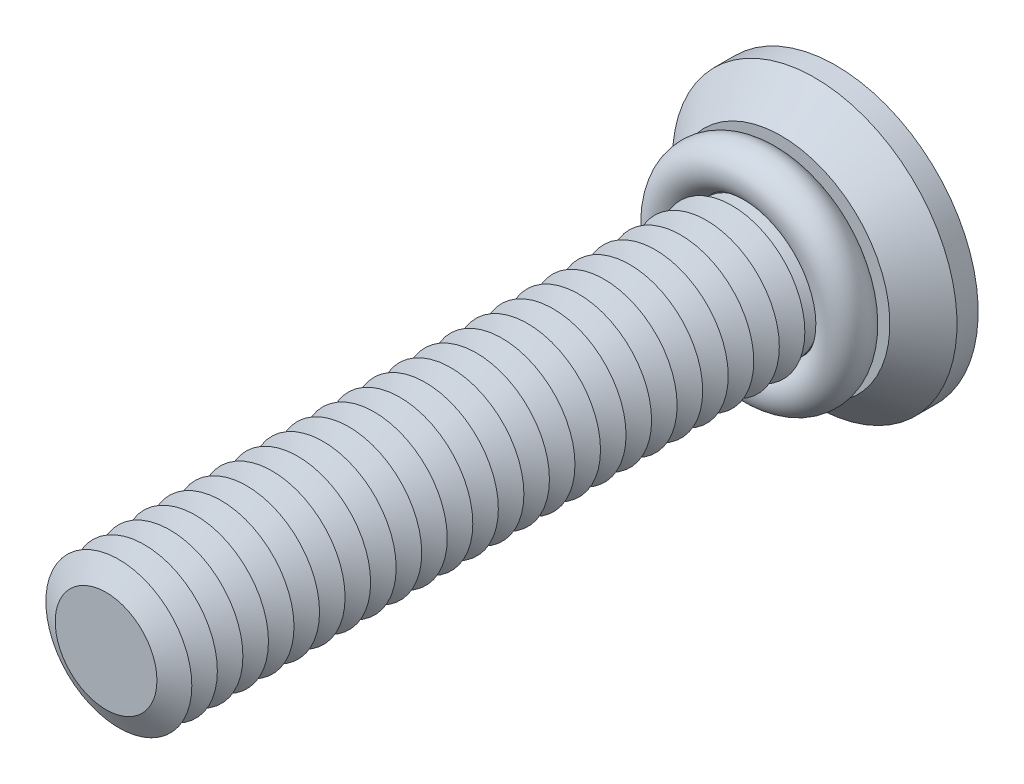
ISO-10303-21;
HEADER;
FILE_DESCRIPTION(('STEP AP214'),'2;1');
FILE_NAME('part.step','',(''),(''),'','','');
FILE_SCHEMA(('AUTOMOTIVE_DESIGN { 1 0 10303 214 1 1 1 1 }'));
ENDSEC;
DATA;
#1=APPLICATION_CONTEXT('core data for automotive mechanical design processes');
#2=APPLICATION_PROTOCOL_DEFINITION('international standard','automotive_design',2000,#1);
#3=PRODUCT_CONTEXT('',#1,'mechanical');
#4=PRODUCT('Part','Part','',(#3));
#5=PRODUCT_RELATED_PRODUCT_CATEGORY('part','',(#4));
#6=PRODUCT_DEFINITION_FORMATION('','',#4);
#7=PRODUCT_DEFINITION_CONTEXT('part definition',#1,'design');
#8=PRODUCT_DEFINITION('design','',#6,#7);
#9=PRODUCT_DEFINITION_SHAPE('','',#8);
#10=(LENGTH_UNIT() NAMED_UNIT(*) SI_UNIT(.MILLI.,.METRE.));
#11=(NAMED_UNIT(*) PLANE_ANGLE_UNIT() SI_UNIT($,.RADIAN.));
#12=(NAMED_UNIT(*) SI_UNIT($,.STERADIAN.) SOLID_ANGLE_UNIT());
#13=UNCERTAINTY_MEASURE_WITH_UNIT(LENGTH_MEASURE(1.E-05),#10,'distance_accuracy_value','');
#14=(GEOMETRIC_REPRESENTATION_CONTEXT(3) GLOBAL_UNCERTAINTY_ASSIGNED_CONTEXT((#13)) GLOBAL_UNIT_ASSIGNED_CONTEXT((#10,
#11,#12)) REPRESENTATION_CONTEXT('',''));
#15=CARTESIAN_POINT('',(0.,0.,0.));
#16=DIRECTION('',(0.,0.,1.));
#17=DIRECTION('',(1.,0.,0.));
#18=AXIS2_PLACEMENT_3D('',#15,#16,#17);
#19=CARTESIAN_POINT('',(0.,0.,2.09999999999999));
#20=DIRECTION('',(0.,0.,1.));
#21=DIRECTION('',(1.,0.,0.));
#22=AXIS2_PLACEMENT_3D('',#19,#20,#21);
#23=TOROIDAL_SURFACE('',#22,2.4,0.6);
#24=CARTESIAN_POINT('',(0.,2.4,2.09999999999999));
#25=DIRECTION('',(1.,0.,0.));
#26=DIRECTION('',(0.,0.,-1.));
#27=AXIS2_PLACEMENT_3D('',#24,#25,#26);
#28=CIRCLE('',#27,0.6);
#29=CARTESIAN_POINT('',(0.,3.,2.09999999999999));
#30=VERTEX_POINT('',#29);
#31=EDGE_CURVE('P0_E10',#30,#30,#28,.T.);
#32=CARTESIAN_POINT('',(0.,0.,2.09999999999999));
#33=DIRECTION('',(0.,0.,1.));
#34=DIRECTION('',(1.,0.,0.));
#35=AXIS2_PLACEMENT_3D('',#32,#33,#34);
#36=CIRCLE('',#35,3.);
#37=EDGE_CURVE('',#30,#30,#36,.T.);
#38=ORIENTED_EDGE('',*,*,#31,.F.);
#39=ORIENTED_EDGE('',*,*,#31,.T.);
#40=ORIENTED_EDGE('',*,*,#37,.T.);
#41=ORIENTED_EDGE('',*,*,#37,.F.);
#42=EDGE_LOOP('',(#38,#40,#39,#41));
#43=FACE_BOUND('',#42,.T.);
#44=ADVANCED_FACE('P0_F14',(#43),#23,.T.);
#45=CLOSED_SHELL('',(#44));
#46=MANIFOLD_SOLID_BREP('P0_B1',#45);
#47=CARTESIAN_POINT('',(0.,0.,16.5));
#48=DIRECTION('',(0.,0.,-1.));
#49=DIRECTION('',(-1.,0.,0.));
#50=AXIS2_PLACEMENT_3D('',#47,#48,#49);
#51=CONICAL_SURFACE('',#50,1.39378221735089,1.04719755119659);
#52=CARTESIAN_POINT('',(0.,0.,16.15));
#53=DIRECTION('',(0.,0.,1.));
#54=DIRECTION('',(1.,0.,0.));
#55=AXIS2_PLACEMENT_3D('',#52,#53,#54);
#56=CIRCLE('',#55,2.);
#57=CARTESIAN_POINT('',(2.,0.,16.15));
#58=VERTEX_POINT('',#57);
#59=EDGE_CURVE('P1_E324',#58,#58,#56,.T.);
#60=ORIENTED_EDGE('',*,*,#59,.T.);
#61=EDGE_LOOP('',(#60));
#62=FACE_BOUND('',#61,.T.);
#63=CARTESIAN_POINT('',(0.,0.,16.5));
#64=DIRECTION('',(0.,0.,1.));
#65=DIRECTION('',(1.,0.,0.));
#66=AXIS2_PLACEMENT_3D('',#63,#64,#65);
#67=CIRCLE('',#66,1.39378221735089);
#68=CARTESIAN_POINT('',(1.39378221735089,0.,16.5));
#69=VERTEX_POINT('',#68);
#70=EDGE_CURVE('P1_E321',#69,#69,#67,.T.);
#71=ORIENTED_EDGE('',*,*,#70,.F.);
#72=EDGE_LOOP('',(#71));
#73=FACE_BOUND('',#72,.T.);
#74=ADVANCED_FACE('P1_F15',(#62,#73),#51,.T.);
#75=CARTESIAN_POINT('',(0.,0.,16.85));
#76=DIRECTION('',(0.,0.,1.));
#77=DIRECTION('',(1.,0.,0.));
#78=AXIS2_PLACEMENT_3D('',#75,#76,#77);
#79=CONICAL_SURFACE('',#78,2.,1.0471975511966);
#80=ORIENTED_EDGE('',*,*,#70,.T.);
#81=EDGE_LOOP('',(#80));
#82=FACE_BOUND('',#81,.T.);
#83=CARTESIAN_POINT('',(0.,0.,16.85));
#84=DIRECTION('',(0.,0.,1.));
#85=DIRECTION('',(1.,0.,0.));
#86=AXIS2_PLACEMENT_3D('',#83,#84,#85);
#87=CIRCLE('',#86,2.);
#88=CARTESIAN_POINT('',(2.,0.,16.85));
#89=VERTEX_POINT('',#88);
#90=EDGE_CURVE('P1_E318',#89,#89,#87,.T.);
#91=ORIENTED_EDGE('',*,*,#90,.F.);
#92=EDGE_LOOP('',(#91));
#93=FACE_BOUND('',#92,.T.);
#94=ADVANCED_FACE('P1_F245',(#82,#93),#79,.T.);
#95=CARTESIAN_POINT('',(0.,0.,20.));
#96=DIRECTION('',(0.,0.,1.));
#97=DIRECTION('',(1.,0.,0.));
#98=AXIS2_PLACEMENT_3D('',#95,#96,#97);
#99=PLANE('',#98);
#100=CARTESIAN_POINT('',(0.,0.,20.));
#101=DIRECTION('',(0.,0.,1.));
#102=DIRECTION('',(1.,0.,0.));
#103=AXIS2_PLACEMENT_3D('',#100,#101,#102);
#104=CIRCLE('',#103,1.39378221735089);
#105=CARTESIAN_POINT('',(1.39378221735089,0.,20.));
#106=VERTEX_POINT('',#105);
#107=EDGE_CURVE('P1_E131',#106,#106,#104,.T.);
#108=ORIENTED_EDGE('',*,*,#107,.T.);
#109=EDGE_LOOP('',(#108));
#110=FACE_BOUND('',#109,.T.);
#111=ADVANCED_FACE('P1_F251',(#110),#99,.T.);
#112=CARTESIAN_POINT('',(0.,0.,20.));
#113=DIRECTION('',(0.,0.,-1.));
#114=DIRECTION('',(-1.,0.,0.));
#115=AXIS2_PLACEMENT_3D('',#112,#113,#114);
#116=CONICAL_SURFACE('',#115,1.39378221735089,1.04719755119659);
#117=CARTESIAN_POINT('',(0.,0.,19.65));
#118=DIRECTION('',(0.,0.,1.));
#119=DIRECTION('',(1.,0.,0.));
#120=AXIS2_PLACEMENT_3D('',#117,#118,#119);
#121=CIRCLE('',#120,2.);
#122=CARTESIAN_POINT('',(2.,0.,19.65));
#123=VERTEX_POINT('',#122);
#124=EDGE_CURVE('P1_E133',#123,#123,#121,.T.);
#125=ORIENTED_EDGE('',*,*,#124,.T.);
#126=EDGE_LOOP('',(#125));
#127=FACE_BOUND('',#126,.T.);
#128=ORIENTED_EDGE('',*,*,#107,.F.);
#129=EDGE_LOOP('',(#128));
#130=FACE_BOUND('',#129,.T.);
#131=ADVANCED_FACE('P1_F196',(#127,#130),#116,.T.);
#132=CARTESIAN_POINT('',(0.,0.,19.65));
#133=DIRECTION('',(0.,0.,1.));
#134=DIRECTION('',(1.,0.,0.));
#135=AXIS2_PLACEMENT_3D('',#132,#133,#134);
#136=CONICAL_SURFACE('',#135,2.,1.0471975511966);
#137=CARTESIAN_POINT('',(0.,0.,19.3));
#138=DIRECTION('',(0.,0.,1.));
#139=DIRECTION('',(1.,0.,0.));
#140=AXIS2_PLACEMENT_3D('',#137,#138,#139);
#141=CIRCLE('',#140,1.39378221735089);
#142=CARTESIAN_POINT('',(1.39378221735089,0.,19.3));
#143=VERTEX_POINT('',#142);
#144=EDGE_CURVE('P1_E297',#143,#143,#141,.T.);
#145=ORIENTED_EDGE('',*,*,#144,.T.);
#146=EDGE_LOOP('',(#145));
#147=FACE_BOUND('',#146,.T.);
#148=ORIENTED_EDGE('',*,*,#124,.F.);
#149=EDGE_LOOP('',(#148));
#150=FACE_BOUND('',#149,.T.);
#151=ADVANCED_FACE('P1_F284',(#147,#150),#136,.T.);
#152=CARTESIAN_POINT('',(0.,0.,19.3));
#153=DIRECTION('',(0.,0.,-1.));
#154=DIRECTION('',(-1.,0.,0.));
#155=AXIS2_PLACEMENT_3D('',#152,#153,#154);
#156=CONICAL_SURFACE('',#155,1.39378221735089,1.04719755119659);
#157=CARTESIAN_POINT('',(0.,0.,18.95));
#158=DIRECTION('',(0.,0.,1.));
#159=DIRECTION('',(1.,0.,0.));
#160=AXIS2_PLACEMENT_3D('',#157,#158,#159);
#161=CIRCLE('',#160,2.);
#162=CARTESIAN_POINT('',(2.,0.,18.95));
#163=VERTEX_POINT('',#162);
#164=EDGE_CURVE('P1_E294',#163,#163,#161,.T.);
#165=ORIENTED_EDGE('',*,*,#164,.T.);
#166=EDGE_LOOP('',(#165));
#167=FACE_BOUND('',#166,.T.);
#168=ORIENTED_EDGE('',*,*,#144,.F.);
#169=EDGE_LOOP('',(#168));
#170=FACE_BOUND('',#169,.T.);
#171=ADVANCED_FACE('P1_F279',(#167,#170),#156,.T.);
#172=CARTESIAN_POINT('',(0.,0.,18.95));
#173=DIRECTION('',(0.,0.,1.));
#174=DIRECTION('',(1.,0.,0.));
#175=AXIS2_PLACEMENT_3D('',#172,#173,#174);
#176=CONICAL_SURFACE('',#175,2.,1.0471975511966);
#177=CARTESIAN_POINT('',(0.,0.,18.6));
#178=DIRECTION('',(0.,0.,1.));
#179=DIRECTION('',(1.,0.,0.));
#180=AXIS2_PLACEMENT_3D('',#177,#178,#179);
#181=CIRCLE('',#180,1.39378221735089);
#182=CARTESIAN_POINT('',(1.39378221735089,0.,18.6));
#183=VERTEX_POINT('',#182);
#184=EDGE_CURVE('P1_E301',#183,#183,#181,.T.);
#185=ORIENTED_EDGE('',*,*,#184,.T.);
#186=EDGE_LOOP('',(#185));
#187=FACE_BOUND('',#186,.T.);
#188=ORIENTED_EDGE('',*,*,#164,.F.);
#189=EDGE_LOOP('',(#188));
#190=FACE_BOUND('',#189,.T.);
#191=ADVANCED_FACE('P1_F276',(#187,#190),#176,.T.);
#192=CARTESIAN_POINT('',(0.,0.,18.6));
#193=DIRECTION('',(0.,0.,-1.));
#194=DIRECTION('',(-1.,0.,0.));
#195=AXIS2_PLACEMENT_3D('',#192,#193,#194);
#196=CONICAL_SURFACE('',#195,1.39378221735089,1.04719755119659);
#197=CARTESIAN_POINT('',(0.,0.,18.25));
#198=DIRECTION('',(0.,0.,1.));
#199=DIRECTION('',(1.,0.,0.));
#200=AXIS2_PLACEMENT_3D('',#197,#198,#199);
#201=CIRCLE('',#200,2.);
#202=CARTESIAN_POINT('',(2.,0.,18.25));
#203=VERTEX_POINT('',#202);
#204=EDGE_CURVE('P1_E306',#203,#203,#201,.T.);
#205=ORIENTED_EDGE('',*,*,#204,.T.);
#206=EDGE_LOOP('',(#205));
#207=FACE_BOUND('',#206,.T.);
#208=ORIENTED_EDGE('',*,*,#184,.F.);
#209=EDGE_LOOP('',(#208));
#210=FACE_BOUND('',#209,.T.);
#211=ADVANCED_FACE('P1_F271',(#207,#210),#196,.T.);
#212=CARTESIAN_POINT('',(0.,0.,18.25));
#213=DIRECTION('',(0.,0.,1.));
#214=DIRECTION('',(1.,0.,0.));
#215=AXIS2_PLACEMENT_3D('',#212,#213,#214);
#216=CONICAL_SURFACE('',#215,2.,1.0471975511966);
#217=CARTESIAN_POINT('',(0.,0.,17.9));
#218=DIRECTION('',(0.,0.,1.));
#219=DIRECTION('',(1.,0.,0.));
#220=AXIS2_PLACEMENT_3D('',#217,#218,#219);
#221=CIRCLE('',#220,1.39378221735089);
#222=CARTESIAN_POINT('',(1.39378221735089,0.,17.9));
#223=VERTEX_POINT('',#222);
#224=EDGE_CURVE('P1_E309',#223,#223,#221,.T.);
#225=ORIENTED_EDGE('',*,*,#224,.T.);
#226=EDGE_LOOP('',(#225));
#227=FACE_BOUND('',#226,.T.);
#228=ORIENTED_EDGE('',*,*,#204,.F.);
#229=EDGE_LOOP('',(#228));
#230=FACE_BOUND('',#229,.T.);
#231=ADVANCED_FACE('P1_F268',(#227,#230),#216,.T.);
#232=CARTESIAN_POINT('',(0.,0.,17.9));
#233=DIRECTION('',(0.,0.,-1.));
#234=DIRECTION('',(-1.,0.,0.));
#235=AXIS2_PLACEMENT_3D('',#232,#233,#234);
#236=CONICAL_SURFACE('',#235,1.39378221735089,1.04719755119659);
#237=CARTESIAN_POINT('',(0.,0.,17.55));
#238=DIRECTION('',(0.,0.,1.));
#239=DIRECTION('',(1.,0.,0.));
#240=AXIS2_PLACEMENT_3D('',#237,#238,#239);
#241=CIRCLE('',#240,2.);
#242=CARTESIAN_POINT('',(2.,0.,17.55));
#243=VERTEX_POINT('',#242);
#244=EDGE_CURVE('P1_E312',#243,#243,#241,.T.);
#245=ORIENTED_EDGE('',*,*,#244,.T.);
#246=EDGE_LOOP('',(#245));
#247=FACE_BOUND('',#246,.T.);
#248=ORIENTED_EDGE('',*,*,#224,.F.);
#249=EDGE_LOOP('',(#248));
#250=FACE_BOUND('',#249,.T.);
#251=ADVANCED_FACE('P1_F262',(#247,#250),#236,.T.);
#252=CARTESIAN_POINT('',(0.,0.,17.55));
#253=DIRECTION('',(0.,0.,1.));
#254=DIRECTION('',(1.,0.,0.));
#255=AXIS2_PLACEMENT_3D('',#252,#253,#254);
#256=CONICAL_SURFACE('',#255,2.,1.0471975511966);
#257=CARTESIAN_POINT('',(0.,0.,17.2));
#258=DIRECTION('',(0.,0.,1.));
#259=DIRECTION('',(1.,0.,0.));
#260=AXIS2_PLACEMENT_3D('',#257,#258,#259);
#261=CIRCLE('',#260,1.39378221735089);
#262=CARTESIAN_POINT('',(1.39378221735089,0.,17.2));
#263=VERTEX_POINT('',#262);
#264=EDGE_CURVE('P1_E315',#263,#263,#261,.T.);
#265=ORIENTED_EDGE('',*,*,#264,.T.);
#266=EDGE_LOOP('',(#265));
#267=FACE_BOUND('',#266,.T.);
#268=ORIENTED_EDGE('',*,*,#244,.F.);
#269=EDGE_LOOP('',(#268));
#270=FACE_BOUND('',#269,.T.);
#271=ADVANCED_FACE('P1_F258',(#267,#270),#256,.T.);
#272=CARTESIAN_POINT('',(0.,0.,17.2));
#273=DIRECTION('',(0.,0.,-1.));
#274=DIRECTION('',(-1.,0.,0.));
#275=AXIS2_PLACEMENT_3D('',#272,#273,#274);
#276=CONICAL_SURFACE('',#275,1.39378221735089,1.04719755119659);
#277=ORIENTED_EDGE('',*,*,#90,.T.);
#278=EDGE_LOOP('',(#277));
#279=FACE_BOUND('',#278,.T.);
#280=ORIENTED_EDGE('',*,*,#264,.F.);
#281=EDGE_LOOP('',(#280));
#282=FACE_BOUND('',#281,.T.);
#283=ADVANCED_FACE('P1_F261',(#279,#282),#276,.T.);
#284=CARTESIAN_POINT('',(0.,0.,15.8));
#285=DIRECTION('',(0.,0.,-1.));
#286=DIRECTION('',(-1.,0.,0.));
#287=AXIS2_PLACEMENT_3D('',#284,#285,#286);
#288=CONICAL_SURFACE('',#287,1.39378221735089,1.04719755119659);
#289=CARTESIAN_POINT('',(0.,0.,15.45));
#290=DIRECTION('',(0.,0.,1.));
#291=DIRECTION('',(1.,0.,0.));
#292=AXIS2_PLACEMENT_3D('',#289,#290,#291);
#293=CIRCLE('',#292,2.);
#294=CARTESIAN_POINT('',(2.,0.,15.45));
#295=VERTEX_POINT('',#294);
#296=EDGE_CURVE('P1_E329',#295,#295,#293,.T.);
#297=ORIENTED_EDGE('',*,*,#296,.T.);
#298=EDGE_LOOP('',(#297));
#299=FACE_BOUND('',#298,.T.);
#300=CARTESIAN_POINT('',(0.,0.,15.8));
#301=DIRECTION('',(0.,0.,1.));
#302=DIRECTION('',(1.,0.,0.));
#303=AXIS2_PLACEMENT_3D('',#300,#301,#302);
#304=CIRCLE('',#303,1.39378221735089);
#305=CARTESIAN_POINT('',(1.39378221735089,0.,15.8));
#306=VERTEX_POINT('',#305);
#307=EDGE_CURVE('P1_E326',#306,#306,#304,.T.);
#308=ORIENTED_EDGE('',*,*,#307,.F.);
#309=EDGE_LOOP('',(#308));
#310=FACE_BOUND('',#309,.T.);
#311=ADVANCED_FACE('P1_F266',(#299,#310),#288,.T.);
#312=CARTESIAN_POINT('',(0.,0.,16.15));
#313=DIRECTION('',(0.,0.,1.));
#314=DIRECTION('',(1.,0.,0.));
#315=AXIS2_PLACEMENT_3D('',#312,#313,#314);
#316=CONICAL_SURFACE('',#315,2.,1.0471975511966);
#317=ORIENTED_EDGE('',*,*,#307,.T.);
#318=EDGE_LOOP('',(#317));
#319=FACE_BOUND('',#318,.T.);
#320=ORIENTED_EDGE('',*,*,#59,.F.);
#321=EDGE_LOOP('',(#320));
#322=FACE_BOUND('',#321,.T.);
#323=ADVANCED_FACE('P1_F545',(#319,#322),#316,.T.);
#324=CARTESIAN_POINT('',(0.,0.,15.1));
#325=DIRECTION('',(0.,0.,-1.));
#326=DIRECTION('',(-1.,0.,0.));
#327=AXIS2_PLACEMENT_3D('',#324,#325,#326);
#328=CONICAL_SURFACE('',#327,1.39378221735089,1.04719755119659);
#329=CARTESIAN_POINT('',(0.,0.,14.75));
#330=DIRECTION('',(0.,0.,1.));
#331=DIRECTION('',(1.,0.,0.));
#332=AXIS2_PLACEMENT_3D('',#329,#330,#331);
#333=CIRCLE('',#332,2.);
#334=CARTESIAN_POINT('',(2.,0.,14.75));
#335=VERTEX_POINT('',#334);
#336=EDGE_CURVE('P1_E335',#335,#335,#333,.T.);
#337=ORIENTED_EDGE('',*,*,#336,.T.);
#338=EDGE_LOOP('',(#337));
#339=FACE_BOUND('',#338,.T.);
#340=CARTESIAN_POINT('',(0.,0.,15.1));
#341=DIRECTION('',(0.,0.,1.));
#342=DIRECTION('',(1.,0.,0.));
#343=AXIS2_PLACEMENT_3D('',#340,#341,#342);
#344=CIRCLE('',#343,1.39378221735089);
#345=CARTESIAN_POINT('',(1.39378221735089,0.,15.1));
#346=VERTEX_POINT('',#345);
#347=EDGE_CURVE('P1_E332',#346,#346,#344,.T.);
#348=ORIENTED_EDGE('',*,*,#347,.F.);
#349=EDGE_LOOP('',(#348));
#350=FACE_BOUND('',#349,.T.);
#351=ADVANCED_FACE('P1_F554',(#339,#350),#328,.T.);
#352=CARTESIAN_POINT('',(0.,0.,15.45));
#353=DIRECTION('',(0.,0.,1.));
#354=DIRECTION('',(1.,0.,0.));
#355=AXIS2_PLACEMENT_3D('',#352,#353,#354);
#356=CONICAL_SURFACE('',#355,2.,1.0471975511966);
#357=ORIENTED_EDGE('',*,*,#347,.T.);
#358=EDGE_LOOP('',(#357));
#359=FACE_BOUND('',#358,.T.);
#360=ORIENTED_EDGE('',*,*,#296,.F.);
#361=EDGE_LOOP('',(#360));
#362=FACE_BOUND('',#361,.T.);
#363=ADVANCED_FACE('P1_F564',(#359,#362),#356,.T.);
#364=CARTESIAN_POINT('',(0.,0.,14.4));
#365=DIRECTION('',(0.,0.,-1.));
#366=DIRECTION('',(-1.,0.,0.));
#367=AXIS2_PLACEMENT_3D('',#364,#365,#366);
#368=CONICAL_SURFACE('',#367,1.39378221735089,1.04719755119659);
#369=CARTESIAN_POINT('',(0.,0.,14.05));
#370=DIRECTION('',(0.,0.,1.));
#371=DIRECTION('',(1.,0.,0.));
#372=AXIS2_PLACEMENT_3D('',#369,#370,#371);
#373=CIRCLE('',#372,2.);
#374=CARTESIAN_POINT('',(2.,0.,14.05));
#375=VERTEX_POINT('',#374);
#376=EDGE_CURVE('P1_E341',#375,#375,#373,.T.);
#377=ORIENTED_EDGE('',*,*,#376,.T.);
#378=EDGE_LOOP('',(#377));
#379=FACE_BOUND('',#378,.T.);
#380=CARTESIAN_POINT('',(0.,0.,14.4));
#381=DIRECTION('',(0.,0.,1.));
#382=DIRECTION('',(1.,0.,0.));
#383=AXIS2_PLACEMENT_3D('',#380,#381,#382);
#384=CIRCLE('',#383,1.39378221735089);
#385=CARTESIAN_POINT('',(1.39378221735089,0.,14.4));
#386=VERTEX_POINT('',#385);
#387=EDGE_CURVE('P1_E338',#386,#386,#384,.T.);
#388=ORIENTED_EDGE('',*,*,#387,.F.);
#389=EDGE_LOOP('',(#388));
#390=FACE_BOUND('',#389,.T.);
#391=ADVANCED_FACE('P1_F574',(#379,#390),#368,.T.);
#392=CARTESIAN_POINT('',(0.,0.,14.75));
#393=DIRECTION('',(0.,0.,1.));
#394=DIRECTION('',(1.,0.,0.));
#395=AXIS2_PLACEMENT_3D('',#392,#393,#394);
#396=CONICAL_SURFACE('',#395,2.,1.0471975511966);
#397=ORIENTED_EDGE('',*,*,#387,.T.);
#398=EDGE_LOOP('',(#397));
#399=FACE_BOUND('',#398,.T.);
#400=ORIENTED_EDGE('',*,*,#336,.F.);
#401=EDGE_LOOP('',(#400));
#402=FACE_BOUND('',#401,.T.);
#403=ADVANCED_FACE('P1_F584',(#399,#402),#396,.T.);
#404=CARTESIAN_POINT('',(0.,0.,13.7));
#405=DIRECTION('',(0.,0.,-1.));
#406=DIRECTION('',(-1.,0.,0.));
#407=AXIS2_PLACEMENT_3D('',#404,#405,#406);
#408=CONICAL_SURFACE('',#407,1.39378221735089,1.04719755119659);
#409=CARTESIAN_POINT('',(0.,0.,13.35));
#410=DIRECTION('',(0.,0.,1.));
#411=DIRECTION('',(1.,0.,0.));
#412=AXIS2_PLACEMENT_3D('',#409,#410,#411);
#413=CIRCLE('',#412,2.);
#414=CARTESIAN_POINT('',(2.,0.,13.35));
#415=VERTEX_POINT('',#414);
#416=EDGE_CURVE('P1_E347',#415,#415,#413,.T.);
#417=ORIENTED_EDGE('',*,*,#416,.T.);
#418=EDGE_LOOP('',(#417));
#419=FACE_BOUND('',#418,.T.);
#420=CARTESIAN_POINT('',(0.,0.,13.7));
#421=DIRECTION('',(0.,0.,1.));
#422=DIRECTION('',(1.,0.,0.));
#423=AXIS2_PLACEMENT_3D('',#420,#421,#422);
#424=CIRCLE('',#423,1.39378221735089);
#425=CARTESIAN_POINT('',(1.39378221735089,0.,13.7));
#426=VERTEX_POINT('',#425);
#427=EDGE_CURVE('P1_E344',#426,#426,#424,.T.);
#428=ORIENTED_EDGE('',*,*,#427,.F.);
#429=EDGE_LOOP('',(#428));
#430=FACE_BOUND('',#429,.T.);
#431=ADVANCED_FACE('P1_F594',(#419,#430),#408,.T.);
#432=CARTESIAN_POINT('',(0.,0.,14.05));
#433=DIRECTION('',(0.,0.,1.));
#434=DIRECTION('',(1.,0.,0.));
#435=AXIS2_PLACEMENT_3D('',#432,#433,#434);
#436=CONICAL_SURFACE('',#435,2.,1.0471975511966);
#437=ORIENTED_EDGE('',*,*,#427,.T.);
#438=EDGE_LOOP('',(#437));
#439=FACE_BOUND('',#438,.T.);
#440=ORIENTED_EDGE('',*,*,#376,.F.);
#441=EDGE_LOOP('',(#440));
#442=FACE_BOUND('',#441,.T.);
#443=ADVANCED_FACE('P1_F604',(#439,#442),#436,.T.);
#444=CARTESIAN_POINT('',(0.,0.,13.));
#445=DIRECTION('',(0.,0.,-1.));
#446=DIRECTION('',(-1.,0.,0.));
#447=AXIS2_PLACEMENT_3D('',#444,#445,#446);
#448=CONICAL_SURFACE('',#447,1.39378221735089,1.04719755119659);
#449=CARTESIAN_POINT('',(0.,0.,12.65));
#450=DIRECTION('',(0.,0.,1.));
#451=DIRECTION('',(1.,0.,0.));
#452=AXIS2_PLACEMENT_3D('',#449,#450,#451);
#453=CIRCLE('',#452,2.);
#454=CARTESIAN_POINT('',(2.,0.,12.65));
#455=VERTEX_POINT('',#454);
#456=EDGE_CURVE('P1_E353',#455,#455,#453,.T.);
#457=ORIENTED_EDGE('',*,*,#456,.T.);
#458=EDGE_LOOP('',(#457));
#459=FACE_BOUND('',#458,.T.);
#460=CARTESIAN_POINT('',(0.,0.,13.));
#461=DIRECTION('',(0.,0.,1.));
#462=DIRECTION('',(1.,0.,0.));
#463=AXIS2_PLACEMENT_3D('',#460,#461,#462);
#464=CIRCLE('',#463,1.39378221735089);
#465=CARTESIAN_POINT('',(1.39378221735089,0.,13.));
#466=VERTEX_POINT('',#465);
#467=EDGE_CURVE('P1_E350',#466,#466,#464,.T.);
#468=ORIENTED_EDGE('',*,*,#467,.F.);
#469=EDGE_LOOP('',(#468));
#470=FACE_BOUND('',#469,.T.);
#471=ADVANCED_FACE('P1_F614',(#459,#470),#448,.T.);
#472=CARTESIAN_POINT('',(0.,0.,13.35));
#473=DIRECTION('',(0.,0.,1.));
#474=DIRECTION('',(1.,0.,0.));
#475=AXIS2_PLACEMENT_3D('',#472,#473,#474);
#476=CONICAL_SURFACE('',#475,2.,1.0471975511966);
#477=ORIENTED_EDGE('',*,*,#467,.T.);
#478=EDGE_LOOP('',(#477));
#479=FACE_BOUND('',#478,.T.);
#480=ORIENTED_EDGE('',*,*,#416,.F.);
#481=EDGE_LOOP('',(#480));
#482=FACE_BOUND('',#481,.T.);
#483=ADVANCED_FACE('P1_F624',(#479,#482),#476,.T.);
#484=CARTESIAN_POINT('',(0.,0.,12.3));
#485=DIRECTION('',(0.,0.,-1.));
#486=DIRECTION('',(-1.,0.,0.));
#487=AXIS2_PLACEMENT_3D('',#484,#485,#486);
#488=CONICAL_SURFACE('',#487,1.39378221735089,1.04719755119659);
#489=CARTESIAN_POINT('',(0.,0.,11.95));
#490=DIRECTION('',(0.,0.,1.));
#491=DIRECTION('',(1.,0.,0.));
#492=AXIS2_PLACEMENT_3D('',#489,#490,#491);
#493=CIRCLE('',#492,2.);
#494=CARTESIAN_POINT('',(2.,0.,11.95));
#495=VERTEX_POINT('',#494);
#496=EDGE_CURVE('P1_E359',#495,#495,#493,.T.);
#497=ORIENTED_EDGE('',*,*,#496,.T.);
#498=EDGE_LOOP('',(#497));
#499=FACE_BOUND('',#498,.T.);
#500=CARTESIAN_POINT('',(0.,0.,12.3));
#501=DIRECTION('',(0.,0.,1.));
#502=DIRECTION('',(1.,0.,0.));
#503=AXIS2_PLACEMENT_3D('',#500,#501,#502);
#504=CIRCLE('',#503,1.39378221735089);
#505=CARTESIAN_POINT('',(1.39378221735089,0.,12.3));
#506=VERTEX_POINT('',#505);
#507=EDGE_CURVE('P1_E356',#506,#506,#504,.T.);
#508=ORIENTED_EDGE('',*,*,#507,.F.);
#509=EDGE_LOOP('',(#508));
#510=FACE_BOUND('',#509,.T.);
#511=ADVANCED_FACE('P1_F634',(#499,#510),#488,.T.);
#512=CARTESIAN_POINT('',(0.,0.,12.65));
#513=DIRECTION('',(0.,0.,1.));
#514=DIRECTION('',(1.,0.,0.));
#515=AXIS2_PLACEMENT_3D('',#512,#513,#514);
#516=CONICAL_SURFACE('',#515,2.,1.0471975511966);
#517=ORIENTED_EDGE('',*,*,#507,.T.);
#518=EDGE_LOOP('',(#517));
#519=FACE_BOUND('',#518,.T.);
#520=ORIENTED_EDGE('',*,*,#456,.F.);
#521=EDGE_LOOP('',(#520));
#522=FACE_BOUND('',#521,.T.);
#523=ADVANCED_FACE('P1_F644',(#519,#522),#516,.T.);
#524=CARTESIAN_POINT('',(0.,0.,11.6));
#525=DIRECTION('',(0.,0.,-1.));
#526=DIRECTION('',(-1.,0.,0.));
#527=AXIS2_PLACEMENT_3D('',#524,#525,#526);
#528=CONICAL_SURFACE('',#527,1.39378221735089,1.04719755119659);
#529=CARTESIAN_POINT('',(0.,0.,11.25));
#530=DIRECTION('',(0.,0.,1.));
#531=DIRECTION('',(1.,0.,0.));
#532=AXIS2_PLACEMENT_3D('',#529,#530,#531);
#533=CIRCLE('',#532,2.);
#534=CARTESIAN_POINT('',(2.,0.,11.25));
#535=VERTEX_POINT('',#534);
#536=EDGE_CURVE('P1_E365',#535,#535,#533,.T.);
#537=ORIENTED_EDGE('',*,*,#536,.T.);
#538=EDGE_LOOP('',(#537));
#539=FACE_BOUND('',#538,.T.);
#540=CARTESIAN_POINT('',(0.,0.,11.6));
#541=DIRECTION('',(0.,0.,1.));
#542=DIRECTION('',(1.,0.,0.));
#543=AXIS2_PLACEMENT_3D('',#540,#541,#542);
#544=CIRCLE('',#543,1.39378221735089);
#545=CARTESIAN_POINT('',(1.39378221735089,0.,11.6));
#546=VERTEX_POINT('',#545);
#547=EDGE_CURVE('P1_E362',#546,#546,#544,.T.);
#548=ORIENTED_EDGE('',*,*,#547,.F.);
#549=EDGE_LOOP('',(#548));
#550=FACE_BOUND('',#549,.T.);
#551=ADVANCED_FACE('P1_F654',(#539,#550),#528,.T.);
#552=CARTESIAN_POINT('',(0.,0.,11.95));
#553=DIRECTION('',(0.,0.,1.));
#554=DIRECTION('',(1.,0.,0.));
#555=AXIS2_PLACEMENT_3D('',#552,#553,#554);
#556=CONICAL_SURFACE('',#555,2.,1.0471975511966);
#557=ORIENTED_EDGE('',*,*,#547,.T.);
#558=EDGE_LOOP('',(#557));
#559=FACE_BOUND('',#558,.T.);
#560=ORIENTED_EDGE('',*,*,#496,.F.);
#561=EDGE_LOOP('',(#560));
#562=FACE_BOUND('',#561,.T.);
#563=ADVANCED_FACE('P1_F664',(#559,#562),#556,.T.);
#564=CARTESIAN_POINT('',(0.,0.,10.9));
#565=DIRECTION('',(0.,0.,-1.));
#566=DIRECTION('',(-1.,0.,0.));
#567=AXIS2_PLACEMENT_3D('',#564,#565,#566);
#568=CONICAL_SURFACE('',#567,1.39378221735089,1.04719755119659);
#569=CARTESIAN_POINT('',(0.,0.,10.55));
#570=DIRECTION('',(0.,0.,1.));
#571=DIRECTION('',(1.,0.,0.));
#572=AXIS2_PLACEMENT_3D('',#569,#570,#571);
#573=CIRCLE('',#572,2.);
#574=CARTESIAN_POINT('',(2.,0.,10.55));
#575=VERTEX_POINT('',#574);
#576=EDGE_CURVE('P1_E371',#575,#575,#573,.T.);
#577=ORIENTED_EDGE('',*,*,#576,.T.);
#578=EDGE_LOOP('',(#577));
#579=FACE_BOUND('',#578,.T.);
#580=CARTESIAN_POINT('',(0.,0.,10.9));
#581=DIRECTION('',(0.,0.,1.));
#582=DIRECTION('',(1.,0.,0.));
#583=AXIS2_PLACEMENT_3D('',#580,#581,#582);
#584=CIRCLE('',#583,1.39378221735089);
#585=CARTESIAN_POINT('',(1.39378221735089,0.,10.9));
#586=VERTEX_POINT('',#585);
#587=EDGE_CURVE('P1_E368',#586,#586,#584,.T.);
#588=ORIENTED_EDGE('',*,*,#587,.F.);
#589=EDGE_LOOP('',(#588));
#590=FACE_BOUND('',#589,.T.);
#591=ADVANCED_FACE('P1_F674',(#579,#590),#568,.T.);
#592=CARTESIAN_POINT('',(0.,0.,11.25));
#593=DIRECTION('',(0.,0.,1.));
#594=DIRECTION('',(1.,0.,0.));
#595=AXIS2_PLACEMENT_3D('',#592,#593,#594);
#596=CONICAL_SURFACE('',#595,2.,1.0471975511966);
#597=ORIENTED_EDGE('',*,*,#587,.T.);
#598=EDGE_LOOP('',(#597));
#599=FACE_BOUND('',#598,.T.);
#600=ORIENTED_EDGE('',*,*,#536,.F.);
#601=EDGE_LOOP('',(#600));
#602=FACE_BOUND('',#601,.T.);
#603=ADVANCED_FACE('P1_F684',(#599,#602),#596,.T.);
#604=CARTESIAN_POINT('',(0.,0.,10.2));
#605=DIRECTION('',(0.,0.,-1.));
#606=DIRECTION('',(-1.,0.,0.));
#607=AXIS2_PLACEMENT_3D('',#604,#605,#606);
#608=CONICAL_SURFACE('',#607,1.39378221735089,1.04719755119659);
#609=CARTESIAN_POINT('',(0.,0.,9.85));
#610=DIRECTION('',(0.,0.,1.));
#611=DIRECTION('',(1.,0.,0.));
#612=AXIS2_PLACEMENT_3D('',#609,#610,#611);
#613=CIRCLE('',#612,2.);
#614=CARTESIAN_POINT('',(2.,0.,9.85));
#615=VERTEX_POINT('',#614);
#616=EDGE_CURVE('P1_E377',#615,#615,#613,.T.);
#617=ORIENTED_EDGE('',*,*,#616,.T.);
#618=EDGE_LOOP('',(#617));
#619=FACE_BOUND('',#618,.T.);
#620=CARTESIAN_POINT('',(0.,0.,10.2));
#621=DIRECTION('',(0.,0.,1.));
#622=DIRECTION('',(1.,0.,0.));
#623=AXIS2_PLACEMENT_3D('',#620,#621,#622);
#624=CIRCLE('',#623,1.39378221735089);
#625=CARTESIAN_POINT('',(1.39378221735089,0.,10.2));
#626=VERTEX_POINT('',#625);
#627=EDGE_CURVE('P1_E374',#626,#626,#624,.T.);
#628=ORIENTED_EDGE('',*,*,#627,.F.);
#629=EDGE_LOOP('',(#628));
#630=FACE_BOUND('',#629,.T.);
#631=ADVANCED_FACE('P1_F694',(#619,#630),#608,.T.);
#632=CARTESIAN_POINT('',(0.,0.,10.55));
#633=DIRECTION('',(0.,0.,1.));
#634=DIRECTION('',(1.,0.,0.));
#635=AXIS2_PLACEMENT_3D('',#632,#633,#634);
#636=CONICAL_SURFACE('',#635,2.,1.0471975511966);
#637=ORIENTED_EDGE('',*,*,#627,.T.);
#638=EDGE_LOOP('',(#637));
#639=FACE_BOUND('',#638,.T.);
#640=ORIENTED_EDGE('',*,*,#576,.F.);
#641=EDGE_LOOP('',(#640));
#642=FACE_BOUND('',#641,.T.);
#643=ADVANCED_FACE('P1_F704',(#639,#642),#636,.T.);
#644=CARTESIAN_POINT('',(0.,0.,9.5));
#645=DIRECTION('',(0.,0.,-1.));
#646=DIRECTION('',(-1.,0.,0.));
#647=AXIS2_PLACEMENT_3D('',#644,#645,#646);
#648=CONICAL_SURFACE('',#647,1.39378221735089,1.04719755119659);
#649=CARTESIAN_POINT('',(0.,0.,9.15));
#650=DIRECTION('',(0.,0.,1.));
#651=DIRECTION('',(1.,0.,0.));
#652=AXIS2_PLACEMENT_3D('',#649,#650,#651);
#653=CIRCLE('',#652,2.);
#654=CARTESIAN_POINT('',(2.,0.,9.15));
#655=VERTEX_POINT('',#654);
#656=EDGE_CURVE('P1_E383',#655,#655,#653,.T.);
#657=ORIENTED_EDGE('',*,*,#656,.T.);
#658=EDGE_LOOP('',(#657));
#659=FACE_BOUND('',#658,.T.);
#660=CARTESIAN_POINT('',(0.,0.,9.5));
#661=DIRECTION('',(0.,0.,1.));
#662=DIRECTION('',(1.,0.,0.));
#663=AXIS2_PLACEMENT_3D('',#660,#661,#662);
#664=CIRCLE('',#663,1.39378221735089);
#665=CARTESIAN_POINT('',(1.39378221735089,0.,9.5));
#666=VERTEX_POINT('',#665);
#667=EDGE_CURVE('P1_E380',#666,#666,#664,.T.);
#668=ORIENTED_EDGE('',*,*,#667,.F.);
#669=EDGE_LOOP('',(#668));
#670=FACE_BOUND('',#669,.T.);
#671=ADVANCED_FACE('P1_F714',(#659,#670),#648,.T.);
#672=CARTESIAN_POINT('',(0.,0.,9.85));
#673=DIRECTION('',(0.,0.,1.));
#674=DIRECTION('',(1.,0.,0.));
#675=AXIS2_PLACEMENT_3D('',#672,#673,#674);
#676=CONICAL_SURFACE('',#675,2.,1.0471975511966);
#677=ORIENTED_EDGE('',*,*,#667,.T.);
#678=EDGE_LOOP('',(#677));
#679=FACE_BOUND('',#678,.T.);
#680=ORIENTED_EDGE('',*,*,#616,.F.);
#681=EDGE_LOOP('',(#680));
#682=FACE_BOUND('',#681,.T.);
#683=ADVANCED_FACE('P1_F724',(#679,#682),#676,.T.);
#684=CARTESIAN_POINT('',(0.,0.,8.8));
#685=DIRECTION('',(0.,0.,-1.));
#686=DIRECTION('',(-1.,0.,0.));
#687=AXIS2_PLACEMENT_3D('',#684,#685,#686);
#688=CONICAL_SURFACE('',#687,1.39378221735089,1.04719755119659);
#689=CARTESIAN_POINT('',(0.,0.,8.45));
#690=DIRECTION('',(0.,0.,1.));
#691=DIRECTION('',(1.,0.,0.));
#692=AXIS2_PLACEMENT_3D('',#689,#690,#691);
#693=CIRCLE('',#692,2.);
#694=CARTESIAN_POINT('',(2.,0.,8.45));
#695=VERTEX_POINT('',#694);
#696=EDGE_CURVE('P1_E389',#695,#695,#693,.T.);
#697=ORIENTED_EDGE('',*,*,#696,.T.);
#698=EDGE_LOOP('',(#697));
#699=FACE_BOUND('',#698,.T.);
#700=CARTESIAN_POINT('',(0.,0.,8.8));
#701=DIRECTION('',(0.,0.,1.));
#702=DIRECTION('',(1.,0.,0.));
#703=AXIS2_PLACEMENT_3D('',#700,#701,#702);
#704=CIRCLE('',#703,1.39378221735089);
#705=CARTESIAN_POINT('',(1.39378221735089,0.,8.8));
#706=VERTEX_POINT('',#705);
#707=EDGE_CURVE('P1_E386',#706,#706,#704,.T.);
#708=ORIENTED_EDGE('',*,*,#707,.F.);
#709=EDGE_LOOP('',(#708));
#710=FACE_BOUND('',#709,.T.);
#711=ADVANCED_FACE('P1_F734',(#699,#710),#688,.T.);
#712=CARTESIAN_POINT('',(0.,0.,9.15));
#713=DIRECTION('',(0.,0.,1.));
#714=DIRECTION('',(1.,0.,0.));
#715=AXIS2_PLACEMENT_3D('',#712,#713,#714);
#716=CONICAL_SURFACE('',#715,2.,1.0471975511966);
#717=ORIENTED_EDGE('',*,*,#707,.T.);
#718=EDGE_LOOP('',(#717));
#719=FACE_BOUND('',#718,.T.);
#720=ORIENTED_EDGE('',*,*,#656,.F.);
#721=EDGE_LOOP('',(#720));
#722=FACE_BOUND('',#721,.T.);
#723=ADVANCED_FACE('P1_F744',(#719,#722),#716,.T.);
#724=CARTESIAN_POINT('',(0.,0.,8.1));
#725=DIRECTION('',(0.,0.,-1.));
#726=DIRECTION('',(-1.,0.,0.));
#727=AXIS2_PLACEMENT_3D('',#724,#725,#726);
#728=CONICAL_SURFACE('',#727,1.39378221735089,1.04719755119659);
#729=CARTESIAN_POINT('',(0.,0.,7.75));
#730=DIRECTION('',(0.,0.,1.));
#731=DIRECTION('',(1.,0.,0.));
#732=AXIS2_PLACEMENT_3D('',#729,#730,#731);
#733=CIRCLE('',#732,2.);
#734=CARTESIAN_POINT('',(2.,0.,7.75));
#735=VERTEX_POINT('',#734);
#736=EDGE_CURVE('P1_E395',#735,#735,#733,.T.);
#737=ORIENTED_EDGE('',*,*,#736,.T.);
#738=EDGE_LOOP('',(#737));
#739=FACE_BOUND('',#738,.T.);
#740=CARTESIAN_POINT('',(0.,0.,8.1));
#741=DIRECTION('',(0.,0.,1.));
#742=DIRECTION('',(1.,0.,0.));
#743=AXIS2_PLACEMENT_3D('',#740,#741,#742);
#744=CIRCLE('',#743,1.39378221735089);
#745=CARTESIAN_POINT('',(1.39378221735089,0.,8.1));
#746=VERTEX_POINT('',#745);
#747=EDGE_CURVE('P1_E392',#746,#746,#744,.T.);
#748=ORIENTED_EDGE('',*,*,#747,.F.);
#749=EDGE_LOOP('',(#748));
#750=FACE_BOUND('',#749,.T.);
#751=ADVANCED_FACE('P1_F754',(#739,#750),#728,.T.);
#752=CARTESIAN_POINT('',(0.,0.,8.45));
#753=DIRECTION('',(0.,0.,1.));
#754=DIRECTION('',(1.,0.,0.));
#755=AXIS2_PLACEMENT_3D('',#752,#753,#754);
#756=CONICAL_SURFACE('',#755,2.,1.0471975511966);
#757=ORIENTED_EDGE('',*,*,#747,.T.);
#758=EDGE_LOOP('',(#757));
#759=FACE_BOUND('',#758,.T.);
#760=ORIENTED_EDGE('',*,*,#696,.F.);
#761=EDGE_LOOP('',(#760));
#762=FACE_BOUND('',#761,.T.);
#763=ADVANCED_FACE('P1_F764',(#759,#762),#756,.T.);
#764=CARTESIAN_POINT('',(0.,0.,7.4));
#765=DIRECTION('',(0.,0.,-1.));
#766=DIRECTION('',(-1.,0.,0.));
#767=AXIS2_PLACEMENT_3D('',#764,#765,#766);
#768=CONICAL_SURFACE('',#767,1.39378221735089,1.04719755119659);
#769=CARTESIAN_POINT('',(0.,0.,7.05));
#770=DIRECTION('',(0.,0.,1.));
#771=DIRECTION('',(1.,0.,0.));
#772=AXIS2_PLACEMENT_3D('',#769,#770,#771);
#773=CIRCLE('',#772,2.);
#774=CARTESIAN_POINT('',(2.,0.,7.05));
#775=VERTEX_POINT('',#774);
#776=EDGE_CURVE('P1_E401',#775,#775,#773,.T.);
#777=ORIENTED_EDGE('',*,*,#776,.T.);
#778=EDGE_LOOP('',(#777));
#779=FACE_BOUND('',#778,.T.);
#780=CARTESIAN_POINT('',(0.,0.,7.4));
#781=DIRECTION('',(0.,0.,1.));
#782=DIRECTION('',(1.,0.,0.));
#783=AXIS2_PLACEMENT_3D('',#780,#781,#782);
#784=CIRCLE('',#783,1.39378221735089);
#785=CARTESIAN_POINT('',(1.39378221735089,0.,7.4));
#786=VERTEX_POINT('',#785);
#787=EDGE_CURVE('P1_E398',#786,#786,#784,.T.);
#788=ORIENTED_EDGE('',*,*,#787,.F.);
#789=EDGE_LOOP('',(#788));
#790=FACE_BOUND('',#789,.T.);
#791=ADVANCED_FACE('P1_F774',(#779,#790),#768,.T.);
#792=CARTESIAN_POINT('',(0.,0.,7.75));
#793=DIRECTION('',(0.,0.,1.));
#794=DIRECTION('',(1.,0.,0.));
#795=AXIS2_PLACEMENT_3D('',#792,#793,#794);
#796=CONICAL_SURFACE('',#795,2.,1.0471975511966);
#797=ORIENTED_EDGE('',*,*,#787,.T.);
#798=EDGE_LOOP('',(#797));
#799=FACE_BOUND('',#798,.T.);
#800=ORIENTED_EDGE('',*,*,#736,.F.);
#801=EDGE_LOOP('',(#800));
#802=FACE_BOUND('',#801,.T.);
#803=ADVANCED_FACE('P1_F784',(#799,#802),#796,.T.);
#804=CARTESIAN_POINT('',(0.,0.,6.7));
#805=DIRECTION('',(0.,0.,-1.));
#806=DIRECTION('',(-1.,0.,0.));
#807=AXIS2_PLACEMENT_3D('',#804,#805,#806);
#808=CONICAL_SURFACE('',#807,1.39378221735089,1.04719755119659);
#809=CARTESIAN_POINT('',(0.,0.,6.35));
#810=DIRECTION('',(0.,0.,1.));
#811=DIRECTION('',(1.,0.,0.));
#812=AXIS2_PLACEMENT_3D('',#809,#810,#811);
#813=CIRCLE('',#812,2.);
#814=CARTESIAN_POINT('',(2.,0.,6.35));
#815=VERTEX_POINT('',#814);
#816=EDGE_CURVE('P1_E407',#815,#815,#813,.T.);
#817=ORIENTED_EDGE('',*,*,#816,.T.);
#818=EDGE_LOOP('',(#817));
#819=FACE_BOUND('',#818,.T.);
#820=CARTESIAN_POINT('',(0.,0.,6.7));
#821=DIRECTION('',(0.,0.,1.));
#822=DIRECTION('',(1.,0.,0.));
#823=AXIS2_PLACEMENT_3D('',#820,#821,#822);
#824=CIRCLE('',#823,1.39378221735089);
#825=CARTESIAN_POINT('',(1.39378221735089,0.,6.7));
#826=VERTEX_POINT('',#825);
#827=EDGE_CURVE('P1_E404',#826,#826,#824,.T.);
#828=ORIENTED_EDGE('',*,*,#827,.F.);
#829=EDGE_LOOP('',(#828));
#830=FACE_BOUND('',#829,.T.);
#831=ADVANCED_FACE('P1_F794',(#819,#830),#808,.T.);
#832=CARTESIAN_POINT('',(0.,0.,7.05));
#833=DIRECTION('',(0.,0.,1.));
#834=DIRECTION('',(1.,0.,0.));
#835=AXIS2_PLACEMENT_3D('',#832,#833,#834);
#836=CONICAL_SURFACE('',#835,2.,1.0471975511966);
#837=ORIENTED_EDGE('',*,*,#827,.T.);
#838=EDGE_LOOP('',(#837));
#839=FACE_BOUND('',#838,.T.);
#840=ORIENTED_EDGE('',*,*,#776,.F.);
#841=EDGE_LOOP('',(#840));
#842=FACE_BOUND('',#841,.T.);
#843=ADVANCED_FACE('P1_F804',(#839,#842),#836,.T.);
#844=CARTESIAN_POINT('',(0.,0.,6.));
#845=DIRECTION('',(0.,0.,-1.));
#846=DIRECTION('',(-1.,0.,0.));
#847=AXIS2_PLACEMENT_3D('',#844,#845,#846);
#848=CONICAL_SURFACE('',#847,1.39378221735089,1.04719755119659);
#849=CARTESIAN_POINT('',(0.,0.,5.65));
#850=DIRECTION('',(0.,0.,1.));
#851=DIRECTION('',(1.,0.,0.));
#852=AXIS2_PLACEMENT_3D('',#849,#850,#851);
#853=CIRCLE('',#852,2.);
#854=CARTESIAN_POINT('',(2.,0.,5.65));
#855=VERTEX_POINT('',#854);
#856=EDGE_CURVE('P1_E413',#855,#855,#853,.T.);
#857=ORIENTED_EDGE('',*,*,#856,.T.);
#858=EDGE_LOOP('',(#857));
#859=FACE_BOUND('',#858,.T.);
#860=CARTESIAN_POINT('',(0.,0.,6.));
#861=DIRECTION('',(0.,0.,1.));
#862=DIRECTION('',(1.,0.,0.));
#863=AXIS2_PLACEMENT_3D('',#860,#861,#862);
#864=CIRCLE('',#863,1.39378221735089);
#865=CARTESIAN_POINT('',(1.39378221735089,0.,6.));
#866=VERTEX_POINT('',#865);
#867=EDGE_CURVE('P1_E410',#866,#866,#864,.T.);
#868=ORIENTED_EDGE('',*,*,#867,.F.);
#869=EDGE_LOOP('',(#868));
#870=FACE_BOUND('',#869,.T.);
#871=ADVANCED_FACE('P1_F814',(#859,#870),#848,.T.);
#872=CARTESIAN_POINT('',(0.,0.,6.35));
#873=DIRECTION('',(0.,0.,1.));
#874=DIRECTION('',(1.,0.,0.));
#875=AXIS2_PLACEMENT_3D('',#872,#873,#874);
#876=CONICAL_SURFACE('',#875,2.,1.0471975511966);
#877=ORIENTED_EDGE('',*,*,#867,.T.);
#878=EDGE_LOOP('',(#877));
#879=FACE_BOUND('',#878,.T.);
#880=ORIENTED_EDGE('',*,*,#816,.F.);
#881=EDGE_LOOP('',(#880));
#882=FACE_BOUND('',#881,.T.);
#883=ADVANCED_FACE('P1_F824',(#879,#882),#876,.T.);
#884=CARTESIAN_POINT('',(0.,0.,5.3));
#885=DIRECTION('',(0.,0.,-1.));
#886=DIRECTION('',(-1.,0.,0.));
#887=AXIS2_PLACEMENT_3D('',#884,#885,#886);
#888=CONICAL_SURFACE('',#887,1.39378221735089,1.04719755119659);
#889=CARTESIAN_POINT('',(0.,0.,4.95));
#890=DIRECTION('',(0.,0.,1.));
#891=DIRECTION('',(1.,0.,0.));
#892=AXIS2_PLACEMENT_3D('',#889,#890,#891);
#893=CIRCLE('',#892,2.);
#894=CARTESIAN_POINT('',(2.,0.,4.95));
#895=VERTEX_POINT('',#894);
#896=EDGE_CURVE('P1_E419',#895,#895,#893,.T.);
#897=ORIENTED_EDGE('',*,*,#896,.T.);
#898=EDGE_LOOP('',(#897));
#899=FACE_BOUND('',#898,.T.);
#900=CARTESIAN_POINT('',(0.,0.,5.3));
#901=DIRECTION('',(0.,0.,1.));
#902=DIRECTION('',(1.,0.,0.));
#903=AXIS2_PLACEMENT_3D('',#900,#901,#902);
#904=CIRCLE('',#903,1.39378221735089);
#905=CARTESIAN_POINT('',(1.39378221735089,0.,5.3));
#906=VERTEX_POINT('',#905);
#907=EDGE_CURVE('P1_E416',#906,#906,#904,.T.);
#908=ORIENTED_EDGE('',*,*,#907,.F.);
#909=EDGE_LOOP('',(#908));
#910=FACE_BOUND('',#909,.T.);
#911=ADVANCED_FACE('P1_F834',(#899,#910),#888,.T.);
#912=CARTESIAN_POINT('',(0.,0.,5.65));
#913=DIRECTION('',(0.,0.,1.));
#914=DIRECTION('',(1.,0.,0.));
#915=AXIS2_PLACEMENT_3D('',#912,#913,#914);
#916=CONICAL_SURFACE('',#915,2.,1.0471975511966);
#917=ORIENTED_EDGE('',*,*,#907,.T.);
#918=EDGE_LOOP('',(#917));
#919=FACE_BOUND('',#918,.T.);
#920=ORIENTED_EDGE('',*,*,#856,.F.);
#921=EDGE_LOOP('',(#920));
#922=FACE_BOUND('',#921,.T.);
#923=ADVANCED_FACE('P1_F844',(#919,#922),#916,.T.);
#924=CARTESIAN_POINT('',(0.,0.,4.6));
#925=DIRECTION('',(0.,0.,-1.));
#926=DIRECTION('',(-1.,0.,0.));
#927=AXIS2_PLACEMENT_3D('',#924,#925,#926);
#928=CONICAL_SURFACE('',#927,1.39378221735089,1.04719755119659);
#929=CARTESIAN_POINT('',(0.,0.,4.25));
#930=DIRECTION('',(0.,0.,1.));
#931=DIRECTION('',(1.,0.,0.));
#932=AXIS2_PLACEMENT_3D('',#929,#930,#931);
#933=CIRCLE('',#932,2.);
#934=CARTESIAN_POINT('',(2.,0.,4.25));
#935=VERTEX_POINT('',#934);
#936=EDGE_CURVE('P1_E425',#935,#935,#933,.T.);
#937=ORIENTED_EDGE('',*,*,#936,.T.);
#938=EDGE_LOOP('',(#937));
#939=FACE_BOUND('',#938,.T.);
#940=CARTESIAN_POINT('',(0.,0.,4.6));
#941=DIRECTION('',(0.,0.,1.));
#942=DIRECTION('',(1.,0.,0.));
#943=AXIS2_PLACEMENT_3D('',#940,#941,#942);
#944=CIRCLE('',#943,1.39378221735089);
#945=CARTESIAN_POINT('',(1.39378221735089,0.,4.6));
#946=VERTEX_POINT('',#945);
#947=EDGE_CURVE('P1_E422',#946,#946,#944,.T.);
#948=ORIENTED_EDGE('',*,*,#947,.F.);
#949=EDGE_LOOP('',(#948));
#950=FACE_BOUND('',#949,.T.);
#951=ADVANCED_FACE('P1_F854',(#939,#950),#928,.T.);
#952=CARTESIAN_POINT('',(0.,0.,4.95));
#953=DIRECTION('',(0.,0.,1.));
#954=DIRECTION('',(1.,0.,0.));
#955=AXIS2_PLACEMENT_3D('',#952,#953,#954);
#956=CONICAL_SURFACE('',#955,2.,1.0471975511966);
#957=ORIENTED_EDGE('',*,*,#947,.T.);
#958=EDGE_LOOP('',(#957));
#959=FACE_BOUND('',#958,.T.);
#960=ORIENTED_EDGE('',*,*,#896,.F.);
#961=EDGE_LOOP('',(#960));
#962=FACE_BOUND('',#961,.T.);
#963=ADVANCED_FACE('P1_F864',(#959,#962),#956,.T.);
#964=CARTESIAN_POINT('',(0.,0.,3.9));
#965=DIRECTION('',(0.,0.,-1.));
#966=DIRECTION('',(-1.,0.,0.));
#967=AXIS2_PLACEMENT_3D('',#964,#965,#966);
#968=CONICAL_SURFACE('',#967,1.39378221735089,1.04719755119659);
#969=CARTESIAN_POINT('',(0.,0.,3.55));
#970=DIRECTION('',(0.,0.,1.));
#971=DIRECTION('',(1.,0.,0.));
#972=AXIS2_PLACEMENT_3D('',#969,#970,#971);
#973=CIRCLE('',#972,2.);
#974=CARTESIAN_POINT('',(2.,0.,3.55));
#975=VERTEX_POINT('',#974);
#976=EDGE_CURVE('P1_E431',#975,#975,#973,.T.);
#977=ORIENTED_EDGE('',*,*,#976,.T.);
#978=EDGE_LOOP('',(#977));
#979=FACE_BOUND('',#978,.T.);
#980=CARTESIAN_POINT('',(0.,0.,3.9));
#981=DIRECTION('',(0.,0.,1.));
#982=DIRECTION('',(1.,0.,0.));
#983=AXIS2_PLACEMENT_3D('',#980,#981,#982);
#984=CIRCLE('',#983,1.39378221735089);
#985=CARTESIAN_POINT('',(1.39378221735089,0.,3.9));
#986=VERTEX_POINT('',#985);
#987=EDGE_CURVE('P1_E428',#986,#986,#984,.T.);
#988=ORIENTED_EDGE('',*,*,#987,.F.);
#989=EDGE_LOOP('',(#988));
#990=FACE_BOUND('',#989,.T.);
#991=ADVANCED_FACE('P1_F874',(#979,#990),#968,.T.);
#992=CARTESIAN_POINT('',(0.,0.,4.25));
#993=DIRECTION('',(0.,0.,1.));
#994=DIRECTION('',(1.,0.,0.));
#995=AXIS2_PLACEMENT_3D('',#992,#993,#994);
#996=CONICAL_SURFACE('',#995,2.,1.0471975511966);
#997=ORIENTED_EDGE('',*,*,#987,.T.);
#998=EDGE_LOOP('',(#997));
#999=FACE_BOUND('',#998,.T.);
#1000=ORIENTED_EDGE('',*,*,#936,.F.);
#1001=EDGE_LOOP('',(#1000));
#1002=FACE_BOUND('',#1001,.T.);
#1003=ADVANCED_FACE('P1_F884',(#999,#1002),#996,.T.);
#1004=CARTESIAN_POINT('',(0.,0.,3.2));
#1005=DIRECTION('',(0.,0.,-1.));
#1006=DIRECTION('',(-1.,0.,0.));
#1007=AXIS2_PLACEMENT_3D('',#1004,#1005,#1006);
#1008=CONICAL_SURFACE('',#1007,1.39378221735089,1.04719755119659);
#1009=CARTESIAN_POINT('',(0.,0.,2.85));
#1010=DIRECTION('',(0.,0.,1.));
#1011=DIRECTION('',(1.,0.,0.));
#1012=AXIS2_PLACEMENT_3D('',#1009,#1010,#1011);
#1013=CIRCLE('',#1012,2.);
#1014=CARTESIAN_POINT('',(2.,0.,2.85));
#1015=VERTEX_POINT('',#1014);
#1016=EDGE_CURVE('P1_E437',#1015,#1015,#1013,.T.);
#1017=ORIENTED_EDGE('',*,*,#1016,.T.);
#1018=EDGE_LOOP('',(#1017));
#1019=FACE_BOUND('',#1018,.T.);
#1020=CARTESIAN_POINT('',(0.,0.,3.2));
#1021=DIRECTION('',(0.,0.,1.));
#1022=DIRECTION('',(1.,0.,0.));
#1023=AXIS2_PLACEMENT_3D('',#1020,#1021,#1022);
#1024=CIRCLE('',#1023,1.39378221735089);
#1025=CARTESIAN_POINT('',(1.39378221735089,0.,3.2));
#1026=VERTEX_POINT('',#1025);
#1027=EDGE_CURVE('P1_E434',#1026,#1026,#1024,.T.);
#1028=ORIENTED_EDGE('',*,*,#1027,.F.);
#1029=EDGE_LOOP('',(#1028));
#1030=FACE_BOUND('',#1029,.T.);
#1031=ADVANCED_FACE('P1_F894',(#1019,#1030),#1008,.T.);
#1032=CARTESIAN_POINT('',(0.,0.,3.55));
#1033=DIRECTION('',(0.,0.,1.));
#1034=DIRECTION('',(1.,0.,0.));
#1035=AXIS2_PLACEMENT_3D('',#1032,#1033,#1034);
#1036=CONICAL_SURFACE('',#1035,2.,1.0471975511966);
#1037=ORIENTED_EDGE('',*,*,#1027,.T.);
#1038=EDGE_LOOP('',(#1037));
#1039=FACE_BOUND('',#1038,.T.);
#1040=ORIENTED_EDGE('',*,*,#976,.F.);
#1041=EDGE_LOOP('',(#1040));
#1042=FACE_BOUND('',#1041,.T.);
#1043=ADVANCED_FACE('P1_F450',(#1039,#1042),#1036,.T.);
#1044=CARTESIAN_POINT('',(0.,0.,2.5));
#1045=DIRECTION('',(0.,0.,-1.));
#1046=DIRECTION('',(-1.,0.,0.));
#1047=AXIS2_PLACEMENT_3D('',#1044,#1045,#1046);
#1048=CONICAL_SURFACE('',#1047,1.39378221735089,1.04719755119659);
#1049=CARTESIAN_POINT('',(0.,0.,2.5));
#1050=DIRECTION('',(0.,0.,1.));
#1051=DIRECTION('',(1.,0.,0.));
#1052=AXIS2_PLACEMENT_3D('',#1049,#1050,#1051);
#1053=CIRCLE('',#1052,1.39378221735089);
#1054=CARTESIAN_POINT('',(1.39378221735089,0.,2.5));
#1055=VERTEX_POINT('',#1054);
#1056=EDGE_CURVE('P1_E440',#1055,#1055,#1053,.T.);
#1057=ORIENTED_EDGE('',*,*,#1056,.F.);
#1058=EDGE_LOOP('',(#1057));
#1059=FACE_BOUND('',#1058,.T.);
#1060=CARTESIAN_POINT('',(0.,0.,2.26547005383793));
#1061=DIRECTION('',(0.,0.,-1.));
#1062=DIRECTION('',(-1.,0.,0.));
#1063=AXIS2_PLACEMENT_3D('',#1060,#1061,#1062);
#1064=CIRCLE('',#1063,1.8);
#1065=CARTESIAN_POINT('',(-1.8,0.,2.26547005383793));
#1066=VERTEX_POINT('',#1065);
#1067=EDGE_CURVE('P1_E19',#1066,#1066,#1064,.F.);
#1068=ORIENTED_EDGE('',*,*,#1067,.T.);
#1069=EDGE_LOOP('',(#1068));
#1070=FACE_BOUND('',#1069,.T.);
#1071=ADVANCED_FACE('P1_F447',(#1059,#1070),#1048,.T.);
#1072=CARTESIAN_POINT('',(0.,0.,2.85));
#1073=DIRECTION('',(0.,0.,1.));
#1074=DIRECTION('',(1.,0.,0.));
#1075=AXIS2_PLACEMENT_3D('',#1072,#1073,#1074);
#1076=CONICAL_SURFACE('',#1075,2.,1.0471975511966);
#1077=ORIENTED_EDGE('',*,*,#1056,.T.);
#1078=EDGE_LOOP('',(#1077));
#1079=FACE_BOUND('',#1078,.T.);
#1080=ORIENTED_EDGE('',*,*,#1016,.F.);
#1081=EDGE_LOOP('',(#1080));
#1082=FACE_BOUND('',#1081,.T.);
#1083=ADVANCED_FACE('P1_F444',(#1079,#1082),#1076,.T.);
#1084=CARTESIAN_POINT('',(0.,0.,1.5));
#1085=DIRECTION('',(0.,0.,-1.));
#1086=DIRECTION('',(-1.,0.,0.));
#1087=AXIS2_PLACEMENT_3D('',#1084,#1085,#1086);
#1088=CONICAL_SURFACE('',#1087,1.25,1.0471975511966);
#1089=CARTESIAN_POINT('',(0.,0.,2.22168783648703));
#1090=VERTEX_POINT('',#1089);
#1091=VERTEX_LOOP('',#1090);
#1092=FACE_BOUND('',#1091,.T.);
#1093=CARTESIAN_POINT('',(0.,0.,1.5));
#1094=DIRECTION('',(0.,0.,-1.));
#1095=DIRECTION('',(-1.,0.,0.));
#1096=AXIS2_PLACEMENT_3D('',#1093,#1094,#1095);
#1097=CIRCLE('',#1096,1.25);
#1098=CARTESIAN_POINT('',(-1.25,0.,1.5));
#1099=VERTEX_POINT('',#1098);
#1100=CARTESIAN_POINT('',(-0.625,1.08253175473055,1.5));
#1101=VERTEX_POINT('',#1100);
#1102=EDGE_CURVE('P1_E117',#1099,#1101,#1097,.T.);
#1103=ORIENTED_EDGE('',*,*,#1102,.T.);
#1104=CARTESIAN_POINT('',(0.,0.,1.5));
#1105=DIRECTION('',(0.,0.,-1.));
#1106=DIRECTION('',(-1.,0.,0.));
#1107=AXIS2_PLACEMENT_3D('',#1104,#1105,#1106);
#1108=CIRCLE('',#1107,1.25);
#1109=CARTESIAN_POINT('',(0.625,1.08253175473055,1.5));
#1110=VERTEX_POINT('',#1109);
#1111=EDGE_CURVE('P1_E24',#1101,#1110,#1108,.T.);
#1112=ORIENTED_EDGE('',*,*,#1111,.T.);
#1113=CARTESIAN_POINT('',(1.25,0.,1.5));
#1114=VERTEX_POINT('',#1113);
#1115=EDGE_CURVE('P1_E1129',#1110,#1114,#1108,.T.);
#1116=ORIENTED_EDGE('',*,*,#1115,.T.);
#1117=CARTESIAN_POINT('',(0.625,-1.08253175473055,1.5));
#1118=VERTEX_POINT('',#1117);
#1119=EDGE_CURVE('P1_E1122',#1114,#1118,#1108,.T.);
#1120=ORIENTED_EDGE('',*,*,#1119,.T.);
#1121=CARTESIAN_POINT('',(-0.624999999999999,-1.08253175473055,1.5));
#1122=VERTEX_POINT('',#1121);
#1123=EDGE_CURVE('P1_E182',#1118,#1122,#1108,.T.);
#1124=ORIENTED_EDGE('',*,*,#1123,.T.);
#1125=EDGE_CURVE('P1_E179',#1122,#1099,#1108,.T.);
#1126=ORIENTED_EDGE('',*,*,#1125,.T.);
#1127=EDGE_LOOP('',(#1103,#1112,#1116,#1120,#1124,#1126));
#1128=FACE_BOUND('',#1127,.T.);
#1129=ADVANCED_FACE('P1_F198',(#1092,#1128),#1088,.F.);
#1130=CARTESIAN_POINT('',(0.,0.,1.5));
#1131=DIRECTION('',(0.,0.,-1.));
#1132=DIRECTION('',(-1.,0.,0.));
#1133=AXIS2_PLACEMENT_3D('',#1130,#1131,#1132);
#1134=PLANE('',#1133);
#1135=ORIENTED_EDGE('',*,*,#1123,.F.);
#1136=DIRECTION('',(-0.866025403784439,-0.5,0.));
#1137=VECTOR('',#1136,1.);
#1138=CARTESIAN_POINT('',(1.25,-0.721687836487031,1.5));
#1139=LINE('',#1138,#1137);
#1140=CARTESIAN_POINT('',(0.,-1.44337567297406,1.5));
#1141=VERTEX_POINT('',#1140);
#1142=EDGE_CURVE('P1_E1138',#1118,#1141,#1139,.T.);
#1143=ORIENTED_EDGE('',*,*,#1142,.T.);
#1144=DIRECTION('',(-0.866025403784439,0.5,0.));
#1145=VECTOR('',#1144,1.);
#1146=CARTESIAN_POINT('',(0.,-1.44337567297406,1.5));
#1147=LINE('',#1146,#1145);
#1148=EDGE_CURVE('P1_E1145',#1141,#1122,#1147,.T.);
#1149=ORIENTED_EDGE('',*,*,#1148,.T.);
#1150=EDGE_LOOP('',(#1135,#1143,#1149));
#1151=FACE_BOUND('',#1150,.T.);
#1152=ADVANCED_FACE('P1_F936',(#1151),#1134,.T.);
#1153=ORIENTED_EDGE('',*,*,#1125,.F.);
#1154=CARTESIAN_POINT('',(-1.25,-0.721687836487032,1.5));
#1155=VERTEX_POINT('',#1154);
#1156=EDGE_CURVE('P1_E1148',#1122,#1155,#1147,.T.);
#1157=ORIENTED_EDGE('',*,*,#1156,.T.);
#1158=DIRECTION('',(0.,1.,0.));
#1159=VECTOR('',#1158,1.);
#1160=CARTESIAN_POINT('',(-1.25,-0.721687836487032,1.5));
#1161=LINE('',#1160,#1159);
#1162=EDGE_CURVE('P1_E123',#1155,#1099,#1161,.T.);
#1163=ORIENTED_EDGE('',*,*,#1162,.T.);
#1164=EDGE_LOOP('',(#1153,#1157,#1163));
#1165=FACE_BOUND('',#1164,.T.);
#1166=ADVANCED_FACE('P1_F231',(#1165),#1134,.T.);
#1167=ORIENTED_EDGE('',*,*,#1102,.F.);
#1168=CARTESIAN_POINT('',(-1.25,0.721687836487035,1.5));
#1169=VERTEX_POINT('',#1168);
#1170=EDGE_CURVE('P1_E1150',#1099,#1169,#1161,.T.);
#1171=ORIENTED_EDGE('',*,*,#1170,.T.);
#1172=DIRECTION('',(0.866025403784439,0.5,0.));
#1173=VECTOR('',#1172,1.);
#1174=CARTESIAN_POINT('',(-1.25,0.721687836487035,1.5));
#1175=LINE('',#1174,#1173);
#1176=EDGE_CURVE('P1_E1153',#1169,#1101,#1175,.T.);
#1177=ORIENTED_EDGE('',*,*,#1176,.T.);
#1178=EDGE_LOOP('',(#1167,#1171,#1177));
#1179=FACE_BOUND('',#1178,.T.);
#1180=ADVANCED_FACE('P1_F953',(#1179),#1134,.T.);
#1181=ORIENTED_EDGE('',*,*,#1111,.F.);
#1182=CARTESIAN_POINT('',(0.,1.44337567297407,1.5));
#1183=VERTEX_POINT('',#1182);
#1184=EDGE_CURVE('P1_E1152',#1101,#1183,#1175,.T.);
#1185=ORIENTED_EDGE('',*,*,#1184,.T.);
#1186=DIRECTION('',(0.866025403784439,-0.5,0.));
#1187=VECTOR('',#1186,1.);
#1188=CARTESIAN_POINT('',(0.,1.44337567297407,1.5));
#1189=LINE('',#1188,#1187);
#1190=EDGE_CURVE('P1_E161',#1183,#1110,#1189,.T.);
#1191=ORIENTED_EDGE('',*,*,#1190,.T.);
#1192=EDGE_LOOP('',(#1181,#1185,#1191));
#1193=FACE_BOUND('',#1192,.T.);
#1194=ADVANCED_FACE('P1_F962',(#1193),#1134,.T.);
#1195=ORIENTED_EDGE('',*,*,#1115,.F.);
#1196=CARTESIAN_POINT('',(1.25,0.721687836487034,1.5));
#1197=VERTEX_POINT('',#1196);
#1198=EDGE_CURVE('P1_E1137',#1110,#1197,#1189,.T.);
#1199=ORIENTED_EDGE('',*,*,#1198,.T.);
#1200=DIRECTION('',(0.,-1.,0.));
#1201=VECTOR('',#1200,1.);
#1202=CARTESIAN_POINT('',(1.25,0.721687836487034,1.5));
#1203=LINE('',#1202,#1201);
#1204=EDGE_CURVE('P1_E1132',#1197,#1114,#1203,.T.);
#1205=ORIENTED_EDGE('',*,*,#1204,.T.);
#1206=EDGE_LOOP('',(#1195,#1199,#1205));
#1207=FACE_BOUND('',#1206,.T.);
#1208=ADVANCED_FACE('P1_F971',(#1207),#1134,.T.);
#1209=ORIENTED_EDGE('',*,*,#1119,.F.);
#1210=CARTESIAN_POINT('',(1.25,-0.721687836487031,1.5));
#1211=VERTEX_POINT('',#1210);
#1212=EDGE_CURVE('P1_E1124',#1114,#1211,#1203,.T.);
#1213=ORIENTED_EDGE('',*,*,#1212,.T.);
#1214=EDGE_CURVE('P1_E125',#1211,#1118,#1139,.T.);
#1215=ORIENTED_EDGE('',*,*,#1214,.T.);
#1216=EDGE_LOOP('',(#1209,#1213,#1215));
#1217=FACE_BOUND('',#1216,.T.);
#1218=ADVANCED_FACE('P1_F229',(#1217),#1134,.T.);
#1219=CARTESIAN_POINT('',(1.25,-0.721687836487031,1.5));
#1220=DIRECTION('',(0.5,-0.866025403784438,0.));
#1221=DIRECTION('',(0.866025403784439,0.5,0.));
#1222=AXIS2_PLACEMENT_3D('',#1219,#1220,#1221);
#1223=PLANE('',#1222);
#1224=DIRECTION('',(0.,0.,-1.));
#1225=VECTOR('',#1224,1.);
#1226=CARTESIAN_POINT('',(1.25,-0.721687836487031,1.5));
#1227=LINE('',#1226,#1225);
#1228=CARTESIAN_POINT('',(1.25,-0.72168783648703,0.));
#1229=VERTEX_POINT('',#1228);
#1230=EDGE_CURVE('P1_E164',#1211,#1229,#1227,.T.);
#1231=ORIENTED_EDGE('',*,*,#1230,.T.);
#1232=CARTESIAN_POINT('',(1.2502,-0.721572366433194,-3.09438201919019E-05));
#1233=CARTESIAN_POINT('',(1.19827409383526,-0.751551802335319,0.00800698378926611));
#1234=CARTESIAN_POINT('',(1.14625401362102,-0.781585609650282,0.0153042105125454));
#1235=CARTESIAN_POINT('',(1.04203006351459,-0.841759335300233,0.0281248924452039));
#1236=CARTESIAN_POINT('',(0.989826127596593,-0.871899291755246,0.0336476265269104));
#1237=CARTESIAN_POINT('',(0.88555111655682,-0.93210249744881,0.0425967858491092));
#1238=CARTESIAN_POINT('',(0.83348074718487,-0.962165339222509,0.0460338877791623));
#1239=CARTESIAN_POINT('',(0.729273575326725,-1.0223293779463,0.0506427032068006));
#1240=CARTESIAN_POINT('',(0.677136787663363,-1.05243056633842,0.0518148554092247));
#1241=CARTESIAN_POINT('',(0.572863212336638,-1.11263294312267,0.0518148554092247));
#1242=CARTESIAN_POINT('',(0.520726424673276,-1.1427341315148,0.0506427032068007));
#1243=CARTESIAN_POINT('',(0.416519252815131,-1.20289817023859,0.0460338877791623));
#1244=CARTESIAN_POINT('',(0.364448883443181,-1.23296101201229,0.0425967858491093));
#1245=CARTESIAN_POINT('',(0.260173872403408,-1.29316421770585,0.0336476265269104));
#1246=CARTESIAN_POINT('',(0.207969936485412,-1.32330417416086,0.028124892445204));
#1247=CARTESIAN_POINT('',(0.103745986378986,-1.38347789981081,0.0153042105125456));
#1248=CARTESIAN_POINT('',(0.051725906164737,-1.41351170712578,0.00800698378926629));
#1249=CARTESIAN_POINT('',(-0.000199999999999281,-1.4434911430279,-3.09438201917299E-05));
#1250=B_SPLINE_CURVE_WITH_KNOTS('',3,(#1232,#1233,#1234,#1235,#1236,#1237,#1238,#1239,#1240,
#1241,#1242,#1243,#1244,#1245,#1246,#1247,#1248,#1249),.UNSPECIFIED.,.F.,.F.,(4,2,2,2,2,2,2,2,
4),(0.,0.18149525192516,0.363064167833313,0.543695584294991,0.724292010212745,0.904888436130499,
1.08551985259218,1.26708876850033,1.44858402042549),.UNSPECIFIED.);
#1251=CARTESIAN_POINT('',(0.,-1.44337567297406,0.));
#1252=VERTEX_POINT('',#1251);
#1253=EDGE_CURVE('P1_E118',#1229,#1252,#1250,.T.);
#1254=ORIENTED_EDGE('',*,*,#1253,.T.);
#1255=DIRECTION('',(0.,0.,-1.));
#1256=VECTOR('',#1255,1.);
#1257=CARTESIAN_POINT('',(0.,-1.44337567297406,1.5));
#1258=LINE('',#1257,#1256);
#1259=EDGE_CURVE('P1_E116',#1141,#1252,#1258,.T.);
#1260=ORIENTED_EDGE('',*,*,#1259,.F.);
#1261=ORIENTED_EDGE('',*,*,#1142,.F.);
#1262=ORIENTED_EDGE('',*,*,#1214,.F.);
#1263=EDGE_LOOP('',(#1231,#1254,#1260,#1261,#1262));
#1264=FACE_BOUND('',#1263,.T.);
#1265=ADVANCED_FACE('P1_F226',(#1264),#1223,.F.);
#1266=CARTESIAN_POINT('',(0.,-1.44337567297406,1.5));
#1267=DIRECTION('',(-0.5,-0.866025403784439,0.));
#1268=DIRECTION('',(0.866025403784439,-0.5,0.));
#1269=AXIS2_PLACEMENT_3D('',#1266,#1267,#1268);
#1270=PLANE('',#1269);
#1271=ORIENTED_EDGE('',*,*,#1259,.T.);
#1272=CARTESIAN_POINT('',(0.000200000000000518,-1.4434911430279,-3.094382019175E-05));
#1273=CARTESIAN_POINT('',(-0.0517259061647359,-1.41351170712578,0.00800698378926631));
#1274=CARTESIAN_POINT('',(-0.103745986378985,-1.38347789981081,0.0153042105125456));
#1275=CARTESIAN_POINT('',(-0.207969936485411,-1.32330417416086,0.028124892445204));
#1276=CARTESIAN_POINT('',(-0.260173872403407,-1.29316421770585,0.0336476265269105));
#1277=CARTESIAN_POINT('',(-0.364448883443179,-1.23296101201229,0.0425967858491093));
#1278=CARTESIAN_POINT('',(-0.41651925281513,-1.20289817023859,0.0460338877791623));
#1279=CARTESIAN_POINT('',(-0.520726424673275,-1.1427341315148,0.0506427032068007));
#1280=CARTESIAN_POINT('',(-0.572863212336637,-1.11263294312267,0.0518148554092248));
#1281=CARTESIAN_POINT('',(-0.677136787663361,-1.05243056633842,0.0518148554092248));
#1282=CARTESIAN_POINT('',(-0.729273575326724,-1.0223293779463,0.0506427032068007));
#1283=CARTESIAN_POINT('',(-0.833480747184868,-0.96216533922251,0.0460338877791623));
#1284=CARTESIAN_POINT('',(-0.885551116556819,-0.932102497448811,0.0425967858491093));
#1285=CARTESIAN_POINT('',(-0.989826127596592,-0.871899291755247,0.0336476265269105));
#1286=CARTESIAN_POINT('',(-1.04203006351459,-0.841759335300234,0.028124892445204));
#1287=CARTESIAN_POINT('',(-1.14625401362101,-0.781585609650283,0.0153042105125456));
#1288=CARTESIAN_POINT('',(-1.19827409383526,-0.75155180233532,0.00800698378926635));
#1289=CARTESIAN_POINT('',(-1.2502,-0.721572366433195,-3.09438201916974E-05));
#1290=B_SPLINE_CURVE_WITH_KNOTS('',3,(#1272,#1273,#1274,#1275,#1276,#1277,#1278,#1279,#1280,
#1281,#1282,#1283,#1284,#1285,#1286,#1287,#1288,#1289),.UNSPECIFIED.,.F.,.F.,(4,2,2,2,2,2,2,2,
4),(0.,0.18149525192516,0.363064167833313,0.543695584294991,0.724292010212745,0.904888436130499,
1.08551985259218,1.26708876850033,1.44858402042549),.UNSPECIFIED.);
#1291=CARTESIAN_POINT('',(-1.25,-0.721687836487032,0.));
#1292=VERTEX_POINT('',#1291);
#1293=EDGE_CURVE('P1_E94',#1252,#1292,#1290,.T.);
#1294=ORIENTED_EDGE('',*,*,#1293,.T.);
#1295=DIRECTION('',(0.,0.,-1.));
#1296=VECTOR('',#1295,1.);
#1297=CARTESIAN_POINT('',(-1.25,-0.721687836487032,1.5));
#1298=LINE('',#1297,#1296);
#1299=EDGE_CURVE('P1_E112',#1155,#1292,#1298,.T.);
#1300=ORIENTED_EDGE('',*,*,#1299,.F.);
#1301=ORIENTED_EDGE('',*,*,#1156,.F.);
#1302=ORIENTED_EDGE('',*,*,#1148,.F.);
#1303=EDGE_LOOP('',(#1271,#1294,#1300,#1301,#1302));
#1304=FACE_BOUND('',#1303,.T.);
#1305=ADVANCED_FACE('P1_F110',(#1304),#1270,.F.);
#1306=CARTESIAN_POINT('',(-1.25,-0.721687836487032,1.5));
#1307=DIRECTION('',(-1.,0.,0.));
#1308=DIRECTION('',(0.,-1.,0.));
#1309=AXIS2_PLACEMENT_3D('',#1306,#1307,#1308);
#1310=PLANE('',#1309);
#1311=ORIENTED_EDGE('',*,*,#1299,.T.);
#1312=CARTESIAN_POINT('',(-1.25,-1.88400474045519,-0.21907305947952));
#1313=CARTESIAN_POINT('',(-1.25,-1.8275611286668,-0.206472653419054));
#1314=CARTESIAN_POINT('',(-1.25,-1.77108164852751,-0.194032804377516));
#1315=CARTESIAN_POINT('',(-1.25,-1.65803301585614,-0.169555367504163));
#1316=CARTESIAN_POINT('',(-1.25,-1.60146385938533,-0.157517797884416));
#1317=CARTESIAN_POINT('',(-1.25,-1.43148763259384,-0.12210797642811));
#1318=CARTESIAN_POINT('',(-1.25,-1.3179263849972,-0.0994645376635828));
#1319=CARTESIAN_POINT('',(-1.25,-1.09123200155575,-0.0573237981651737));
#1320=CARTESIAN_POINT('',(-1.25,-0.978103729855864,-0.0378008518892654));
#1321=CARTESIAN_POINT('',(-1.25,-0.751170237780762,-0.00320860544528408));
#1322=CARTESIAN_POINT('',(-1.25,-0.637365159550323,0.0118615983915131));
#1323=CARTESIAN_POINT('',(-1.25,-0.407744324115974,0.0355899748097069));
#1324=CARTESIAN_POINT('',(-1.25,-0.291920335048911,0.0441742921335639));
#1325=CARTESIAN_POINT('',(-1.25,-0.117976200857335,0.0506819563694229));
#1326=CARTESIAN_POINT('',(-1.25,-0.0599690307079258,0.0517900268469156));
#1327=CARTESIAN_POINT('',(-1.25,0.0560463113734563,0.0518388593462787));
#1328=CARTESIAN_POINT('',(-1.25,0.114054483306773,0.0507796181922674));
#1329=CARTESIAN_POINT('',(-1.25,0.28842859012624,0.0443978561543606));
#1330=CARTESIAN_POINT('',(-1.25,0.404683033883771,0.0358543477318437));
#1331=CARTESIAN_POINT('',(-1.25,0.636524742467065,0.0119999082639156));
#1332=CARTESIAN_POINT('',(-1.25,0.752111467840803,-0.00331588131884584));
#1333=CARTESIAN_POINT('',(-1.25,0.985585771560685,-0.0389793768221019));
#1334=CARTESIAN_POINT('',(-1.25,1.10345418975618,-0.0594485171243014));
#1335=CARTESIAN_POINT('',(-1.25,1.33861792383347,-0.103481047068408));
#1336=CARTESIAN_POINT('',(-1.25,1.45591314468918,-0.127044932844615));
#1337=CARTESIAN_POINT('',(-1.25,1.69011362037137,-0.176177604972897));
#1338=CARTESIAN_POINT('',(-1.25,1.80701875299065,-0.201746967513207));
#1339=CARTESIAN_POINT('',(-1.25,2.04053091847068,-0.254214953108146));
#1340=CARTESIAN_POINT('',(-1.25,2.15713794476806,-0.281113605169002));
#1341=CARTESIAN_POINT('',(-1.25,2.38871499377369,-0.33548950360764));
#1342=CARTESIAN_POINT('',(-1.25,2.50368762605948,-0.362955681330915));
#1343=CARTESIAN_POINT('',(-1.25,2.7334816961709,-0.41852313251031));
#1344=CARTESIAN_POINT('',(-1.25,2.84830313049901,-0.446624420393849));
#1345=CARTESIAN_POINT('',(-1.25,3.07767157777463,-0.503250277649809));
#1346=CARTESIAN_POINT('',(-1.25,3.19221875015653,-0.531774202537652));
#1347=CARTESIAN_POINT('',(-1.25,3.42122038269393,-0.589174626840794));
#1348=CARTESIAN_POINT('',(-1.25,3.53567484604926,-0.618051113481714));
#1349=CARTESIAN_POINT('',(-1.25,3.65009781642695,-0.647050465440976));
#1350=B_SPLINE_CURVE_WITH_KNOTS('',3,(#1312,#1313,#1314,#1315,#1316,#1317,#1318,#1319,#1320,
#1321,#1322,#1323,#1324,#1325,#1326,#1327,#1328,#1329,#1330,#1331,#1332,#1333,#1334,#1335,#1336,
#1337,#1338,#1339,#1340,#1341,#1342,#1343,#1344,#1345,#1346,#1347,#1348,#1349),.UNSPECIFIED.,
.F.,.F.,(4,2,2,2,2,2,2,2,2,2,2,2,2,2,2,2,2,2,4),(0.,0.173498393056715,0.347004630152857,
0.694369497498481,1.03871380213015,1.382988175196,1.73112607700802,1.90514173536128,
2.07915764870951,2.42857002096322,2.77823347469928,3.13706733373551,3.49595878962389,
3.85495373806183,4.2139565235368,4.56857767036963,4.92320688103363,5.27734186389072,
5.63146405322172),.UNSPECIFIED.);
#1351=CARTESIAN_POINT('',(-1.25,0.721687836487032,0.));
#1352=VERTEX_POINT('',#1351);
#1353=EDGE_CURVE('P1_E10',#1292,#1352,#1350,.T.);
#1354=ORIENTED_EDGE('',*,*,#1353,.T.);
#1355=DIRECTION('',(0.,0.,-1.));
#1356=VECTOR('',#1355,1.);
#1357=CARTESIAN_POINT('',(-1.25,0.721687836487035,1.5));
#1358=LINE('',#1357,#1356);
#1359=EDGE_CURVE('P1_E124',#1169,#1352,#1358,.T.);
#1360=ORIENTED_EDGE('',*,*,#1359,.F.);
#1361=ORIENTED_EDGE('',*,*,#1170,.F.);
#1362=ORIENTED_EDGE('',*,*,#1162,.F.);
#1363=EDGE_LOOP('',(#1311,#1354,#1360,#1361,#1362));
#1364=FACE_BOUND('',#1363,.T.);
#1365=ADVANCED_FACE('P1_F120',(#1364),#1310,.F.);
#1366=CARTESIAN_POINT('',(-1.25,0.721687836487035,1.5));
#1367=DIRECTION('',(-0.5,0.866025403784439,0.));
#1368=DIRECTION('',(-0.866025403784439,-0.5,0.));
#1369=AXIS2_PLACEMENT_3D('',#1366,#1367,#1368);
#1370=PLANE('',#1369);
#1371=ORIENTED_EDGE('',*,*,#1359,.T.);
#1372=CARTESIAN_POINT('',(-1.2502,0.721572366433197,-3.09438201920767E-05));
#1373=CARTESIAN_POINT('',(-1.19827409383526,0.751551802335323,0.00800698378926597));
#1374=CARTESIAN_POINT('',(-1.14625401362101,0.781585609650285,0.0153042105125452));
#1375=CARTESIAN_POINT('',(-1.04203006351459,0.841759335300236,0.0281248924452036));
#1376=CARTESIAN_POINT('',(-0.989826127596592,0.871899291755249,0.03364762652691));
#1377=CARTESIAN_POINT('',(-0.885551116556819,0.932102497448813,0.0425967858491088));
#1378=CARTESIAN_POINT('',(-0.833480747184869,0.962165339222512,0.0460338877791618));
#1379=CARTESIAN_POINT('',(-0.729273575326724,1.0223293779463,0.0506427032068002));
#1380=CARTESIAN_POINT('',(-0.677136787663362,1.05243056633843,0.0518148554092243));
#1381=CARTESIAN_POINT('',(-0.572863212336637,1.11263294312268,0.0518148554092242));
#1382=CARTESIAN_POINT('',(-0.520726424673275,1.1427341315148,0.0506427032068));
#1383=CARTESIAN_POINT('',(-0.416519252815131,1.20289817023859,0.0460338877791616));
#1384=CARTESIAN_POINT('',(-0.36444888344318,1.23296101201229,0.0425967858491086));
#1385=CARTESIAN_POINT('',(-0.260173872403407,1.29316421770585,0.0336476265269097));
#1386=CARTESIAN_POINT('',(-0.207969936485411,1.32330417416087,0.0281248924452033));
#1387=CARTESIAN_POINT('',(-0.103745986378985,1.38347789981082,0.0153042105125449));
#1388=CARTESIAN_POINT('',(-0.0517259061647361,1.41351170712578,0.00800698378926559));
#1389=CARTESIAN_POINT('',(0.000200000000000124,1.4434911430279,-3.09438201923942E-05));
#1390=B_SPLINE_CURVE_WITH_KNOTS('',3,(#1372,#1373,#1374,#1375,#1376,#1377,#1378,#1379,#1380,
#1381,#1382,#1383,#1384,#1385,#1386,#1387,#1388,#1389),.UNSPECIFIED.,.F.,.F.,(4,2,2,2,2,2,2,2,
4),(0.,0.18149525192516,0.363064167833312,0.543695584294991,0.724292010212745,0.904888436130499,
1.08551985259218,1.26708876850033,1.44858402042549),.UNSPECIFIED.);
#1391=CARTESIAN_POINT('',(0.,1.44337567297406,0.));
#1392=VERTEX_POINT('',#1391);
#1393=EDGE_CURVE('P1_E136',#1352,#1392,#1390,.T.);
#1394=ORIENTED_EDGE('',*,*,#1393,.T.);
#1395=DIRECTION('',(0.,0.,-1.));
#1396=VECTOR('',#1395,1.);
#1397=CARTESIAN_POINT('',(0.,1.44337567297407,1.5));
#1398=LINE('',#1397,#1396);
#1399=EDGE_CURVE('P1_E155',#1183,#1392,#1398,.T.);
#1400=ORIENTED_EDGE('',*,*,#1399,.F.);
#1401=ORIENTED_EDGE('',*,*,#1184,.F.);
#1402=ORIENTED_EDGE('',*,*,#1176,.F.);
#1403=EDGE_LOOP('',(#1371,#1394,#1400,#1401,#1402));
#1404=FACE_BOUND('',#1403,.T.);
#1405=ADVANCED_FACE('P1_F153',(#1404),#1370,.F.);
#1406=CARTESIAN_POINT('',(0.,1.44337567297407,1.5));
#1407=DIRECTION('',(0.5,0.866025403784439,0.));
#1408=DIRECTION('',(-0.866025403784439,0.5,0.));
#1409=AXIS2_PLACEMENT_3D('',#1406,#1407,#1408);
#1410=PLANE('',#1409);
#1411=ORIENTED_EDGE('',*,*,#1399,.T.);
#1412=CARTESIAN_POINT('',(-0.000199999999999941,1.4434911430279,-3.09438201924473E-05));
#1413=CARTESIAN_POINT('',(0.0517259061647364,1.41351170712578,0.00800698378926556));
#1414=CARTESIAN_POINT('',(0.103745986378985,1.38347789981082,0.0153042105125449));
#1415=CARTESIAN_POINT('',(0.207969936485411,1.32330417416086,0.0281248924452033));
#1416=CARTESIAN_POINT('',(0.260173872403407,1.29316421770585,0.0336476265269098));
#1417=CARTESIAN_POINT('',(0.36444888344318,1.23296101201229,0.0425967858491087));
#1418=CARTESIAN_POINT('',(0.416519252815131,1.20289817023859,0.0460338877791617));
#1419=CARTESIAN_POINT('',(0.520726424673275,1.1427341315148,0.0506427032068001));
#1420=CARTESIAN_POINT('',(0.572863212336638,1.11263294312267,0.0518148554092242));
#1421=CARTESIAN_POINT('',(0.677136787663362,1.05243056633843,0.0518148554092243));
#1422=CARTESIAN_POINT('',(0.729273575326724,1.0223293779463,0.0506427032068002));
#1423=CARTESIAN_POINT('',(0.833480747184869,0.962165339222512,0.0460338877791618));
#1424=CARTESIAN_POINT('',(0.88555111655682,0.932102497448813,0.0425967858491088));
#1425=CARTESIAN_POINT('',(0.989826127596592,0.871899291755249,0.03364762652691));
#1426=CARTESIAN_POINT('',(1.04203006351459,0.841759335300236,0.0281248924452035));
#1427=CARTESIAN_POINT('',(1.14625401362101,0.781585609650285,0.0153042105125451));
#1428=CARTESIAN_POINT('',(1.19827409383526,0.751551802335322,0.00800698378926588));
#1429=CARTESIAN_POINT('',(1.2502,0.721572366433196,-3.09438201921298E-05));
#1430=B_SPLINE_CURVE_WITH_KNOTS('',3,(#1412,#1413,#1414,#1415,#1416,#1417,#1418,#1419,#1420,
#1421,#1422,#1423,#1424,#1425,#1426,#1427,#1428,#1429),.UNSPECIFIED.,.F.,.F.,(4,2,2,2,2,2,2,2,
4),(0.,0.18149525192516,0.363064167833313,0.543695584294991,0.724292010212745,0.904888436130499,
1.08551985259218,1.26708876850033,1.44858402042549),.UNSPECIFIED.);
#1431=CARTESIAN_POINT('',(1.25,0.721687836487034,0.));
#1432=VERTEX_POINT('',#1431);
#1433=EDGE_CURVE('P1_E141',#1392,#1432,#1430,.T.);
#1434=ORIENTED_EDGE('',*,*,#1433,.T.);
#1435=DIRECTION('',(0.,0.,-1.));
#1436=VECTOR('',#1435,1.);
#1437=CARTESIAN_POINT('',(1.25,0.721687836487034,1.5));
#1438=LINE('',#1437,#1436);
#1439=EDGE_CURVE('P1_E162',#1197,#1432,#1438,.T.);
#1440=ORIENTED_EDGE('',*,*,#1439,.F.);
#1441=ORIENTED_EDGE('',*,*,#1198,.F.);
#1442=ORIENTED_EDGE('',*,*,#1190,.F.);
#1443=EDGE_LOOP('',(#1411,#1434,#1440,#1441,#1442));
#1444=FACE_BOUND('',#1443,.T.);
#1445=ADVANCED_FACE('P1_F158',(#1444),#1410,.F.);
#1446=CARTESIAN_POINT('',(1.25,0.721687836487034,1.5));
#1447=DIRECTION('',(1.,0.,0.));
#1448=DIRECTION('',(0.,1.,0.));
#1449=AXIS2_PLACEMENT_3D('',#1446,#1447,#1448);
#1450=PLANE('',#1449);
#1451=ORIENTED_EDGE('',*,*,#1439,.T.);
#1452=CARTESIAN_POINT('',(1.25,-1.88400474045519,-0.21907305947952));
#1453=CARTESIAN_POINT('',(1.25,-1.8275611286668,-0.206472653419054));
#1454=CARTESIAN_POINT('',(1.25,-1.77108164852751,-0.194032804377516));
#1455=CARTESIAN_POINT('',(1.25,-1.65803301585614,-0.169555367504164));
#1456=CARTESIAN_POINT('',(1.25,-1.60146385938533,-0.157517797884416));
#1457=CARTESIAN_POINT('',(1.25,-1.43148763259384,-0.12210797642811));
#1458=CARTESIAN_POINT('',(1.25,-1.3179263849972,-0.0994645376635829));
#1459=CARTESIAN_POINT('',(1.25,-1.09123200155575,-0.0573237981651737));
#1460=CARTESIAN_POINT('',(1.25,-0.978103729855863,-0.0378008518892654));
#1461=CARTESIAN_POINT('',(1.25,-0.751170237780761,-0.00320860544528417));
#1462=CARTESIAN_POINT('',(1.25,-0.637365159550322,0.0118615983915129));
#1463=CARTESIAN_POINT('',(1.25,-0.407744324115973,0.0355899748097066));
#1464=CARTESIAN_POINT('',(1.25,-0.29192033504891,0.0441742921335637));
#1465=CARTESIAN_POINT('',(1.25,-0.117976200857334,0.0506819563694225));
#1466=CARTESIAN_POINT('',(1.25,-0.0599690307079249,0.0517900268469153));
#1467=CARTESIAN_POINT('',(1.25,0.0560463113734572,0.0518388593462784));
#1468=CARTESIAN_POINT('',(1.25,0.114054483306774,0.050779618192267));
#1469=CARTESIAN_POINT('',(1.25,0.288428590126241,0.0443978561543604));
#1470=CARTESIAN_POINT('',(1.25,0.404683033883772,0.0358543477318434));
#1471=CARTESIAN_POINT('',(1.25,0.636524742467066,0.0119999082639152));
#1472=CARTESIAN_POINT('',(1.25,0.752111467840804,-0.00331588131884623));
#1473=CARTESIAN_POINT('',(1.25,0.985585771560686,-0.0389793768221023));
#1474=CARTESIAN_POINT('',(1.25,1.10345418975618,-0.0594485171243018));
#1475=CARTESIAN_POINT('',(1.25,1.33861792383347,-0.103481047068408));
#1476=CARTESIAN_POINT('',(1.25,1.45591314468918,-0.127044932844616));
#1477=CARTESIAN_POINT('',(1.25,1.69011362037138,-0.176177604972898));
#1478=CARTESIAN_POINT('',(1.25,1.80701875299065,-0.201746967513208));
#1479=CARTESIAN_POINT('',(1.25,2.04053091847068,-0.254214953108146));
#1480=CARTESIAN_POINT('',(1.25,2.15713794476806,-0.281113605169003));
#1481=CARTESIAN_POINT('',(1.25,2.38871499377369,-0.33548950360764));
#1482=CARTESIAN_POINT('',(1.25,2.50368762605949,-0.362955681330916));
#1483=CARTESIAN_POINT('',(1.25,2.7334816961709,-0.418523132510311));
#1484=CARTESIAN_POINT('',(1.25,2.84830313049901,-0.44662442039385));
#1485=CARTESIAN_POINT('',(1.25,3.07767157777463,-0.503250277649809));
#1486=CARTESIAN_POINT('',(1.25,3.19221875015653,-0.531774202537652));
#1487=CARTESIAN_POINT('',(1.25,3.42122038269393,-0.589174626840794));
#1488=CARTESIAN_POINT('',(1.25,3.53567484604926,-0.618051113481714));
#1489=CARTESIAN_POINT('',(1.25,3.65009781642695,-0.647050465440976));
#1490=B_SPLINE_CURVE_WITH_KNOTS('',3,(#1452,#1453,#1454,#1455,#1456,#1457,#1458,#1459,#1460,
#1461,#1462,#1463,#1464,#1465,#1466,#1467,#1468,#1469,#1470,#1471,#1472,#1473,#1474,#1475,#1476,
#1477,#1478,#1479,#1480,#1481,#1482,#1483,#1484,#1485,#1486,#1487,#1488,#1489),.UNSPECIFIED.,
.F.,.F.,(4,2,2,2,2,2,2,2,2,2,2,2,2,2,2,2,2,2,4),(0.,0.173498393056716,0.347004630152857,
0.694369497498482,1.03871380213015,1.382988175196,1.73112607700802,1.90514173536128,
2.07915764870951,2.42857002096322,2.77823347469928,3.13706733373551,3.49595878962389,
3.85495373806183,4.2139565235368,4.56857767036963,4.92320688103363,5.27734186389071,
5.63146405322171),.UNSPECIFIED.);
#1491=EDGE_CURVE('P1_E149',#1432,#1229,#1490,.F.);
#1492=ORIENTED_EDGE('',*,*,#1491,.T.);
#1493=ORIENTED_EDGE('',*,*,#1230,.F.);
#1494=ORIENTED_EDGE('',*,*,#1212,.F.);
#1495=ORIENTED_EDGE('',*,*,#1204,.F.);
#1496=EDGE_LOOP('',(#1451,#1492,#1493,#1494,#1495));
#1497=FACE_BOUND('',#1496,.T.);
#1498=ADVANCED_FACE('P1_F232',(#1497),#1450,.F.);
#1499=CARTESIAN_POINT('',(0.,0.,0.));
#1500=DIRECTION('',(0.,0.,-1.));
#1501=DIRECTION('',(-1.,0.,0.));
#1502=AXIS2_PLACEMENT_3D('',#1499,#1500,#1501);
#1503=CONICAL_SURFACE('',#1502,1.44337567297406,1.30899693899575);
#1504=CARTESIAN_POINT('',(0.,0.,0.));
#1505=DIRECTION('',(0.,0.,-1.));
#1506=DIRECTION('',(-1.,0.,0.));
#1507=AXIS2_PLACEMENT_3D('',#1504,#1505,#1506);
#1508=CIRCLE('',#1507,1.44337567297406);
#1509=EDGE_CURVE('P1_E30',#1229,#1252,#1508,.T.);
#1510=ORIENTED_EDGE('',*,*,#1509,.T.);
#1511=ORIENTED_EDGE('',*,*,#1253,.F.);
#1512=EDGE_LOOP('',(#1510,#1511));
#1513=FACE_BOUND('',#1512,.T.);
#1514=ADVANCED_FACE('P1_F195',(#1513),#1503,.F.);
#1515=EDGE_CURVE('P1_E90',#1252,#1292,#1508,.T.);
#1516=ORIENTED_EDGE('',*,*,#1515,.T.);
#1517=ORIENTED_EDGE('',*,*,#1293,.F.);
#1518=EDGE_LOOP('',(#1516,#1517));
#1519=FACE_BOUND('',#1518,.T.);
#1520=ADVANCED_FACE('P1_F92',(#1519),#1503,.F.);
#1521=EDGE_CURVE('P1_E98',#1292,#1352,#1508,.T.);
#1522=ORIENTED_EDGE('',*,*,#1521,.T.);
#1523=ORIENTED_EDGE('',*,*,#1353,.F.);
#1524=EDGE_LOOP('',(#1522,#1523));
#1525=FACE_BOUND('',#1524,.T.);
#1526=ADVANCED_FACE('P1_F102',(#1525),#1503,.F.);
#1527=EDGE_CURVE('P1_E130',#1352,#1392,#1508,.T.);
#1528=ORIENTED_EDGE('',*,*,#1527,.T.);
#1529=ORIENTED_EDGE('',*,*,#1393,.F.);
#1530=EDGE_LOOP('',(#1528,#1529));
#1531=FACE_BOUND('',#1530,.T.);
#1532=ADVANCED_FACE('P1_F1045',(#1531),#1503,.F.);
#1533=EDGE_CURVE('P1_E137',#1392,#1432,#1508,.T.);
#1534=ORIENTED_EDGE('',*,*,#1533,.T.);
#1535=ORIENTED_EDGE('',*,*,#1433,.F.);
#1536=EDGE_LOOP('',(#1534,#1535));
#1537=FACE_BOUND('',#1536,.T.);
#1538=ADVANCED_FACE('P1_F144',(#1537),#1503,.F.);
#1539=EDGE_CURVE('P1_E37',#1432,#1229,#1508,.T.);
#1540=ORIENTED_EDGE('',*,*,#1539,.T.);
#1541=ORIENTED_EDGE('',*,*,#1491,.F.);
#1542=EDGE_LOOP('',(#1540,#1541));
#1543=FACE_BOUND('',#1542,.T.);
#1544=ADVANCED_FACE('P1_F1031',(#1543),#1503,.F.);
#1545=CARTESIAN_POINT('',(0.,0.,0.));
#1546=DIRECTION('',(0.,0.,1.));
#1547=DIRECTION('',(1.,0.,0.));
#1548=AXIS2_PLACEMENT_3D('',#1545,#1546,#1547);
#1549=PLANE('',#1548);
#1550=ORIENTED_EDGE('',*,*,#1539,.F.);
#1551=ORIENTED_EDGE('',*,*,#1533,.F.);
#1552=ORIENTED_EDGE('',*,*,#1527,.F.);
#1553=ORIENTED_EDGE('',*,*,#1521,.F.);
#1554=ORIENTED_EDGE('',*,*,#1515,.F.);
#1555=ORIENTED_EDGE('',*,*,#1509,.F.);
#1556=EDGE_LOOP('',(#1550,#1551,#1552,#1553,#1554,#1555));
#1557=FACE_BOUND('',#1556,.T.);
#1558=CARTESIAN_POINT('',(0.,0.,0.));
#1559=DIRECTION('',(0.,0.,-1.));
#1560=DIRECTION('',(-1.,0.,0.));
#1561=AXIS2_PLACEMENT_3D('',#1558,#1559,#1560);
#1562=CIRCLE('',#1561,3.9);
#1563=CARTESIAN_POINT('',(-3.9,0.,0.));
#1564=VERTEX_POINT('',#1563);
#1565=EDGE_CURVE('P1_E169',#1564,#1564,#1562,.T.);
#1566=ORIENTED_EDGE('',*,*,#1565,.T.);
#1567=EDGE_LOOP('',(#1566));
#1568=FACE_BOUND('',#1567,.T.);
#1569=ADVANCED_FACE('P1_F17',(#1557,#1568),#1549,.F.);
#1570=CARTESIAN_POINT('',(0.,0.,20.));
#1571=DIRECTION('',(0.,0.,-1.));
#1572=DIRECTION('',(-1.,0.,0.));
#1573=AXIS2_PLACEMENT_3D('',#1570,#1571,#1572);
#1574=CYLINDRICAL_SURFACE('',#1573,3.9);
#1575=ORIENTED_EDGE('',*,*,#1565,.F.);
#1576=EDGE_LOOP('',(#1575));
#1577=FACE_BOUND('',#1576,.T.);
#1578=CARTESIAN_POINT('',(0.,0.,0.580000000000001));
#1579=DIRECTION('',(0.,0.,-1.));
#1580=DIRECTION('',(-1.,0.,0.));
#1581=AXIS2_PLACEMENT_3D('',#1578,#1579,#1580);
#1582=CIRCLE('',#1581,3.9);
#1583=CARTESIAN_POINT('',(-3.9,0.,0.580000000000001));
#1584=VERTEX_POINT('',#1583);
#1585=EDGE_CURVE('P1_E172',#1584,#1584,#1582,.T.);
#1586=ORIENTED_EDGE('',*,*,#1585,.T.);
#1587=EDGE_LOOP('',(#1586));
#1588=FACE_BOUND('',#1587,.T.);
#1589=ADVANCED_FACE('P1_F468',(#1577,#1588),#1574,.T.);
#1590=CARTESIAN_POINT('',(0.,0.,0.));
#1591=DIRECTION('',(0.,0.,-1.));
#1592=DIRECTION('',(-1.,0.,0.));
#1593=AXIS2_PLACEMENT_3D('',#1590,#1591,#1592);
#1594=CONICAL_SURFACE('',#1593,4.48,0.785398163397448);
#1595=CARTESIAN_POINT('',(0.,0.,1.5));
#1596=DIRECTION('',(0.,0.,-1.));
#1597=DIRECTION('',(-1.,0.,0.));
#1598=AXIS2_PLACEMENT_3D('',#1595,#1596,#1597);
#1599=CIRCLE('',#1598,2.98);
#1600=CARTESIAN_POINT('',(-2.98,0.,1.5));
#1601=VERTEX_POINT('',#1600);
#1602=EDGE_CURVE('P1_E176',#1601,#1601,#1599,.T.);
#1603=ORIENTED_EDGE('',*,*,#1602,.T.);
#1604=EDGE_LOOP('',(#1603));
#1605=FACE_BOUND('',#1604,.T.);
#1606=ORIENTED_EDGE('',*,*,#1585,.F.);
#1607=EDGE_LOOP('',(#1606));
#1608=FACE_BOUND('',#1607,.T.);
#1609=ADVANCED_FACE('P1_F463',(#1605,#1608),#1594,.T.);
#1610=CARTESIAN_POINT('',(0.,1.8,1.5));
#1611=DIRECTION('',(0.,0.,-1.));
#1612=DIRECTION('',(-1.,0.,0.));
#1613=AXIS2_PLACEMENT_3D('',#1610,#1611,#1612);
#1614=PLANE('',#1613);
#1615=CARTESIAN_POINT('',(0.,0.,1.5));
#1616=DIRECTION('',(0.,0.,-1.));
#1617=DIRECTION('',(-1.,0.,0.));
#1618=AXIS2_PLACEMENT_3D('',#1615,#1616,#1617);
#1619=CIRCLE('',#1618,1.8);
#1620=CARTESIAN_POINT('',(-1.8,0.,1.5));
#1621=VERTEX_POINT('',#1620);
#1622=EDGE_CURVE('P1_E173',#1621,#1621,#1619,.T.);
#1623=ORIENTED_EDGE('',*,*,#1622,.T.);
#1624=EDGE_LOOP('',(#1623));
#1625=FACE_BOUND('',#1624,.T.);
#1626=ORIENTED_EDGE('',*,*,#1602,.F.);
#1627=EDGE_LOOP('',(#1626));
#1628=FACE_BOUND('',#1627,.T.);
#1629=ADVANCED_FACE('P1_F457',(#1625,#1628),#1614,.F.);
#1630=CARTESIAN_POINT('',(0.,0.,0.));
#1631=DIRECTION('',(0.,0.,-1.));
#1632=DIRECTION('',(-1.,0.,0.));
#1633=AXIS2_PLACEMENT_3D('',#1630,#1631,#1632);
#1634=CYLINDRICAL_SURFACE('',#1633,1.8);
#1635=ORIENTED_EDGE('',*,*,#1622,.F.);
#1636=EDGE_LOOP('',(#1635));
#1637=FACE_BOUND('',#1636,.T.);
#1638=ORIENTED_EDGE('',*,*,#1067,.F.);
#1639=EDGE_LOOP('',(#1638));
#1640=FACE_BOUND('',#1639,.T.);
#1641=ADVANCED_FACE('P1_F455',(#1637,#1640),#1634,.T.);
#1642=CLOSED_SHELL('',(#74,#94,#111,#131,#151,#171,#191,#211,#231,#251,#271,#283,#311,#323,#351,
#363,#391,#403,#431,#443,#471,#483,#511,#523,#551,#563,#591,#603,#631,#643,#671,#683,#711,#723,
#751,#763,#791,#803,#831,#843,#871,#883,#911,#923,#951,#963,#991,#1003,#1031,#1043,#1071,#1083,
#1129,#1152,#1166,#1180,#1194,#1208,#1218,#1265,#1305,#1365,#1405,#1445,#1498,#1514,#1520,#1526,
#1532,#1538,#1544,#1569,#1589,#1609,#1629,#1641));
#1643=MANIFOLD_SOLID_BREP('P1_B1',#1642);
#1644=ADVANCED_BREP_SHAPE_REPRESENTATION('',(#18,#46,#1643),#14);
#1645=SHAPE_DEFINITION_REPRESENTATION(#9,#1644);
ENDSEC;
END-ISO-10303-21;
